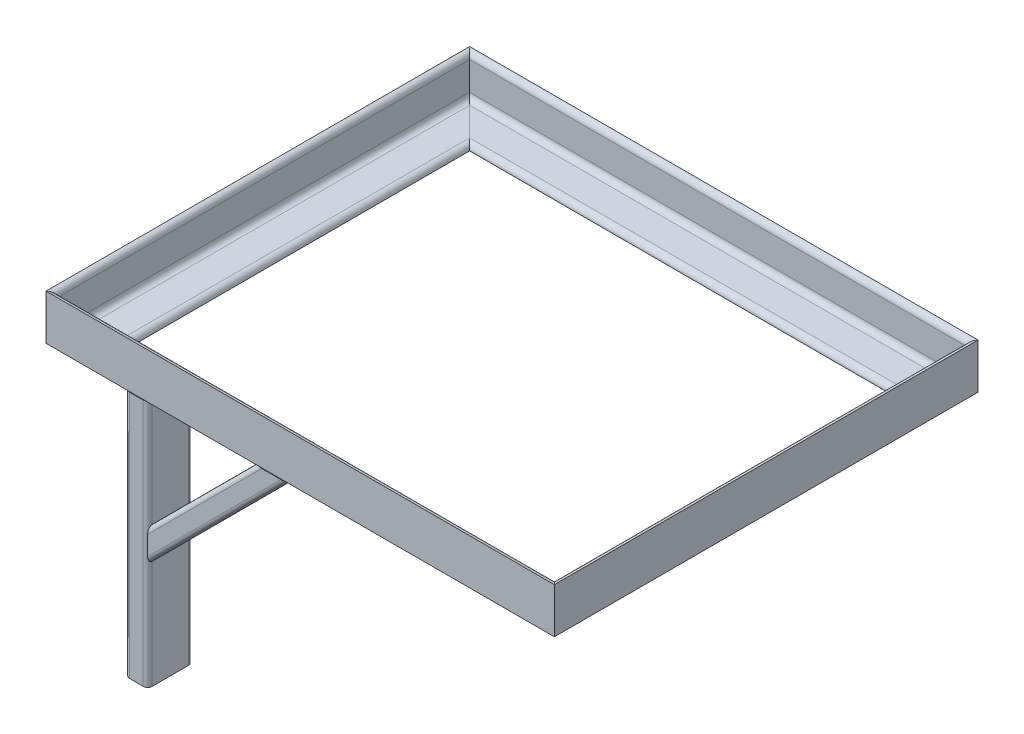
ISO-10303-21;
HEADER;
FILE_DESCRIPTION(('STEP AP214'),'2;1');
FILE_NAME('part.step','',(''),(''),'','','');
FILE_SCHEMA(('AUTOMOTIVE_DESIGN { 1 0 10303 214 1 1 1 1 }'));
ENDSEC;
DATA;
#1=APPLICATION_CONTEXT('core data for automotive mechanical design processes');
#2=APPLICATION_PROTOCOL_DEFINITION('international standard','automotive_design',2000,#1);
#3=PRODUCT_CONTEXT('',#1,'mechanical');
#4=PRODUCT('Part','Part','',(#3));
#5=PRODUCT_RELATED_PRODUCT_CATEGORY('part','',(#4));
#6=PRODUCT_DEFINITION_FORMATION('','',#4);
#7=PRODUCT_DEFINITION_CONTEXT('part definition',#1,'design');
#8=PRODUCT_DEFINITION('design','',#6,#7);
#9=PRODUCT_DEFINITION_SHAPE('','',#8);
#10=(LENGTH_UNIT() NAMED_UNIT(*) SI_UNIT(.MILLI.,.METRE.));
#11=(NAMED_UNIT(*) PLANE_ANGLE_UNIT() SI_UNIT($,.RADIAN.));
#12=(NAMED_UNIT(*) SI_UNIT($,.STERADIAN.) SOLID_ANGLE_UNIT());
#13=UNCERTAINTY_MEASURE_WITH_UNIT(LENGTH_MEASURE(1.E-05),#10,'distance_accuracy_value','');
#14=(GEOMETRIC_REPRESENTATION_CONTEXT(3) GLOBAL_UNCERTAINTY_ASSIGNED_CONTEXT((#13)) GLOBAL_UNIT_ASSIGNED_CONTEXT((#10,
#11,#12)) REPRESENTATION_CONTEXT('',''));
#15=CARTESIAN_POINT('',(0.,0.,0.));
#16=DIRECTION('',(0.,0.,1.));
#17=DIRECTION('',(1.,0.,0.));
#18=AXIS2_PLACEMENT_3D('',#15,#16,#17);
#19=CARTESIAN_POINT('',(-1.51471862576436,491.514718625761,367.));
#20=DIRECTION('',(-0.707106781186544,-0.707106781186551,0.));
#21=DIRECTION('',(0.707106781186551,-0.707106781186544,0.));
#22=AXIS2_PLACEMENT_3D('',#19,#20,#21);
#23=CYLINDRICAL_SURFACE('',#22,8.00000000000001);
#24=CARTESIAN_POINT('',(-270.,223.029437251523,367.));
#25=DIRECTION('',(-1.,0.,0.));
#26=DIRECTION('',(0.,-1.,0.));
#27=AXIS2_PLACEMENT_3D('',#24,#25,#26);
#28=ELLIPSE('',#27,11.3137084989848,8.00000000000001);
#29=CARTESIAN_POINT('',(-270.,211.715728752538,367.));
#30=VERTEX_POINT('',#29);
#31=CARTESIAN_POINT('',(-270.,223.029437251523,375.));
#32=VERTEX_POINT('',#31);
#33=EDGE_CURVE('E270',#30,#32,#28,.T.);
#34=ORIENTED_EDGE('',*,*,#33,.F.);
#35=DIRECTION('',(-0.707106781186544,-0.707106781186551,0.));
#36=VECTOR('',#35,1.);
#37=CARTESIAN_POINT('',(4.14213562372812,485.857864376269,367.));
#38=LINE('',#37,#36);
#39=CARTESIAN_POINT('',(-22.7157287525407,459.,367.));
#40=VERTEX_POINT('',#39);
#41=EDGE_CURVE('E202',#40,#30,#38,.T.);
#42=ORIENTED_EDGE('',*,*,#41,.F.);
#43=CARTESIAN_POINT('',(-34.0294372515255,459.,367.));
#44=DIRECTION('',(0.,-1.,0.));
#45=DIRECTION('',(-1.,0.,0.));
#46=AXIS2_PLACEMENT_3D('',#43,#44,#45);
#47=ELLIPSE('',#46,11.3137084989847,8.00000000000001);
#48=CARTESIAN_POINT('',(-34.0294372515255,459.,375.));
#49=VERTEX_POINT('',#48);
#50=EDGE_CURVE('E297',#40,#49,#47,.T.);
#51=ORIENTED_EDGE('',*,*,#50,.T.);
#52=DIRECTION('',(-0.707106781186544,-0.707106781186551,0.));
#53=VECTOR('',#52,1.);
#54=CARTESIAN_POINT('',(-1.51471862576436,491.514718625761,375.));
#55=LINE('',#54,#53);
#56=EDGE_CURVE('E135',#49,#32,#55,.T.);
#57=ORIENTED_EDGE('',*,*,#56,.T.);
#58=EDGE_LOOP('',(#34,#42,#51,#57));
#59=FACE_BOUND('',#58,.T.);
#60=ADVANCED_FACE('F129',(#59),#23,.T.);
#61=CARTESIAN_POINT('',(-18.4852813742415,508.485281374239,375.));
#62=DIRECTION('',(0.,0.,-1.));
#63=DIRECTION('',(-1.,0.,0.));
#64=AXIS2_PLACEMENT_3D('',#61,#62,#63);
#65=PLANE('',#64);
#66=DIRECTION('',(0.,-1.,0.));
#67=VECTOR('',#66,1.);
#68=CARTESIAN_POINT('',(-270.,500.,375.));
#69=LINE('',#68,#67);
#70=CARTESIAN_POINT('',(-270.,256.970562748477,375.));
#71=VERTEX_POINT('',#70);
#72=EDGE_CURVE('E294',#71,#32,#69,.T.);
#73=ORIENTED_EDGE('',*,*,#72,.T.);
#74=ORIENTED_EDGE('',*,*,#56,.F.);
#75=DIRECTION('',(-1.,0.,0.));
#76=VECTOR('',#75,1.);
#77=CARTESIAN_POINT('',(-18.4852813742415,459.,375.));
#78=LINE('',#77,#76);
#79=CARTESIAN_POINT('',(-67.9705627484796,459.,375.));
#80=VERTEX_POINT('',#79);
#81=EDGE_CURVE('E287',#49,#80,#78,.T.);
#82=ORIENTED_EDGE('',*,*,#81,.T.);
#83=DIRECTION('',(-0.707106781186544,-0.707106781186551,0.));
#84=VECTOR('',#83,1.);
#85=CARTESIAN_POINT('',(-18.4852813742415,508.485281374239,375.));
#86=LINE('',#85,#84);
#87=EDGE_CURVE('E290',#80,#71,#86,.T.);
#88=ORIENTED_EDGE('',*,*,#87,.T.);
#89=EDGE_LOOP('',(#73,#74,#82,#88));
#90=FACE_BOUND('',#89,.T.);
#91=ADVANCED_FACE('F420',(#90),#65,.F.);
#92=CARTESIAN_POINT('',(-18.4852813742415,508.485281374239,367.));
#93=DIRECTION('',(-0.707106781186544,-0.707106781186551,0.));
#94=DIRECTION('',(0.707106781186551,-0.707106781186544,0.));
#95=AXIS2_PLACEMENT_3D('',#92,#93,#94);
#96=CYLINDRICAL_SURFACE('',#95,8.00000000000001);
#97=CARTESIAN_POINT('',(-270.,256.970562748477,367.));
#98=DIRECTION('',(-1.,0.,0.));
#99=DIRECTION('',(0.,-1.,0.));
#100=AXIS2_PLACEMENT_3D('',#97,#98,#99);
#101=ELLIPSE('',#100,11.3137084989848,8.00000000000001);
#102=CARTESIAN_POINT('',(-270.,268.284271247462,367.));
#103=VERTEX_POINT('',#102);
#104=EDGE_CURVE('E336',#71,#103,#101,.T.);
#105=ORIENTED_EDGE('',*,*,#104,.F.);
#106=ORIENTED_EDGE('',*,*,#87,.F.);
#107=CARTESIAN_POINT('',(-67.9705627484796,459.,367.));
#108=DIRECTION('',(0.,-1.,0.));
#109=DIRECTION('',(-1.,0.,0.));
#110=AXIS2_PLACEMENT_3D('',#107,#108,#109);
#111=ELLIPSE('',#110,11.3137084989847,8.00000000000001);
#112=CARTESIAN_POINT('',(-79.2842712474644,459.,367.));
#113=VERTEX_POINT('',#112);
#114=EDGE_CURVE('E283',#80,#113,#111,.T.);
#115=ORIENTED_EDGE('',*,*,#114,.T.);
#116=DIRECTION('',(-0.707106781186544,-0.707106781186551,0.));
#117=VECTOR('',#116,1.);
#118=CARTESIAN_POINT('',(-24.142135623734,514.142135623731,367.));
#119=LINE('',#118,#117);
#120=EDGE_CURVE('E279',#113,#103,#119,.T.);
#121=ORIENTED_EDGE('',*,*,#120,.T.);
#122=EDGE_LOOP('',(#105,#106,#115,#121));
#123=FACE_BOUND('',#122,.T.);
#124=ADVANCED_FACE('F422',(#123),#96,.T.);
#125=CARTESIAN_POINT('',(1.31370849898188,488.686291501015,303.));
#126=DIRECTION('',(-0.707106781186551,0.707106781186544,0.));
#127=DIRECTION('',(-0.707106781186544,-0.707106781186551,0.));
#128=AXIS2_PLACEMENT_3D('',#125,#126,#127);
#129=PLANE('',#128);
#130=DIRECTION('',(-0.707106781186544,-0.707106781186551,0.));
#131=VECTOR('',#130,1.);
#132=CARTESIAN_POINT('',(1.31370849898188,488.686291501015,303.));
#133=LINE('',#132,#131);
#134=CARTESIAN_POINT('',(-28.3725830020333,459.,303.));
#135=VERTEX_POINT('',#134);
#136=CARTESIAN_POINT('',(-270.,217.372583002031,303.));
#137=VERTEX_POINT('',#136);
#138=EDGE_CURVE('E275',#135,#137,#133,.T.);
#139=ORIENTED_EDGE('',*,*,#138,.T.);
#140=DIRECTION('',(0.,0.,1.));
#141=VECTOR('',#140,1.);
#142=CARTESIAN_POINT('',(-270.,217.372583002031,303.));
#143=LINE('',#142,#141);
#144=CARTESIAN_POINT('',(-270.,217.37258300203,367.));
#145=VERTEX_POINT('',#144);
#146=EDGE_CURVE('E171',#137,#145,#143,.T.);
#147=ORIENTED_EDGE('',*,*,#146,.T.);
#148=DIRECTION('',(-0.707106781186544,-0.707106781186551,0.));
#149=VECTOR('',#148,1.);
#150=CARTESIAN_POINT('',(1.31370849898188,488.686291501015,367.));
#151=LINE('',#150,#149);
#152=CARTESIAN_POINT('',(-28.3725830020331,459.,367.));
#153=VERTEX_POINT('',#152);
#154=EDGE_CURVE('E274',#153,#145,#151,.T.);
#155=ORIENTED_EDGE('',*,*,#154,.F.);
#156=DIRECTION('',(0.,0.,1.));
#157=VECTOR('',#156,1.);
#158=CARTESIAN_POINT('',(-28.3725830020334,459.,303.));
#159=LINE('',#158,#157);
#160=EDGE_CURVE('E191',#135,#153,#159,.T.);
#161=ORIENTED_EDGE('',*,*,#160,.F.);
#162=EDGE_LOOP('',(#139,#147,#155,#161));
#163=FACE_BOUND('',#162,.T.);
#164=ADVANCED_FACE('F272',(#163),#129,.T.);
#165=CARTESIAN_POINT('',(-1.51471862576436,491.514718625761,303.));
#166=DIRECTION('',(-0.707106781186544,-0.707106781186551,0.));
#167=DIRECTION('',(0.707106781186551,-0.707106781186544,0.));
#168=AXIS2_PLACEMENT_3D('',#165,#166,#167);
#169=CYLINDRICAL_SURFACE('',#168,4.);
#170=DIRECTION('',(-0.707106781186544,-0.707106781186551,0.));
#171=VECTOR('',#170,1.);
#172=CARTESIAN_POINT('',(-1.51471862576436,491.514718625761,299.));
#173=LINE('',#172,#171);
#174=CARTESIAN_POINT('',(-34.0294372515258,459.,299.));
#175=VERTEX_POINT('',#174);
#176=CARTESIAN_POINT('',(-270.,223.029437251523,299.));
#177=VERTEX_POINT('',#176);
#178=EDGE_CURVE('E278',#175,#177,#173,.T.);
#179=ORIENTED_EDGE('',*,*,#178,.T.);
#180=CARTESIAN_POINT('',(-270.,223.029437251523,303.));
#181=DIRECTION('',(-1.,0.,0.));
#182=DIRECTION('',(0.,-1.,0.));
#183=AXIS2_PLACEMENT_3D('',#180,#181,#182);
#184=ELLIPSE('',#183,5.65685424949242,4.);
#185=EDGE_CURVE('E166',#177,#137,#184,.T.);
#186=ORIENTED_EDGE('',*,*,#185,.T.);
#187=ORIENTED_EDGE('',*,*,#138,.F.);
#188=CARTESIAN_POINT('',(-34.0294372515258,459.,303.));
#189=DIRECTION('',(0.,-1.,0.));
#190=DIRECTION('',(-1.,0.,0.));
#191=AXIS2_PLACEMENT_3D('',#188,#189,#190);
#192=ELLIPSE('',#191,5.65685424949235,4.);
#193=EDGE_CURVE('E265',#175,#135,#192,.T.);
#194=ORIENTED_EDGE('',*,*,#193,.F.);
#195=EDGE_LOOP('',(#179,#186,#187,#194));
#196=FACE_BOUND('',#195,.T.);
#197=ADVANCED_FACE('F280',(#196),#169,.F.);
#198=CARTESIAN_POINT('',(-1.51471862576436,491.514718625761,299.));
#199=DIRECTION('',(0.,0.,1.));
#200=DIRECTION('',(1.,0.,0.));
#201=AXIS2_PLACEMENT_3D('',#198,#199,#200);
#202=PLANE('',#201);
#203=DIRECTION('',(-0.707106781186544,-0.707106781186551,0.));
#204=VECTOR('',#203,1.);
#205=CARTESIAN_POINT('',(-18.4852813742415,508.485281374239,299.));
#206=LINE('',#205,#204);
#207=CARTESIAN_POINT('',(-67.9705627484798,459.,299.));
#208=VERTEX_POINT('',#207);
#209=CARTESIAN_POINT('',(-270.,256.970562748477,299.));
#210=VERTEX_POINT('',#209);
#211=EDGE_CURVE('E361',#208,#210,#206,.T.);
#212=ORIENTED_EDGE('',*,*,#211,.T.);
#213=DIRECTION('',(0.,-1.,0.));
#214=VECTOR('',#213,1.);
#215=CARTESIAN_POINT('',(-270.,491.514718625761,299.));
#216=LINE('',#215,#214);
#217=EDGE_CURVE('E359',#210,#177,#216,.T.);
#218=ORIENTED_EDGE('',*,*,#217,.T.);
#219=ORIENTED_EDGE('',*,*,#178,.F.);
#220=DIRECTION('',(1.,0.,0.));
#221=VECTOR('',#220,1.);
#222=CARTESIAN_POINT('',(-1.51471862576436,459.,299.));
#223=LINE('',#222,#221);
#224=EDGE_CURVE('E258',#208,#175,#223,.T.);
#225=ORIENTED_EDGE('',*,*,#224,.F.);
#226=EDGE_LOOP('',(#212,#218,#219,#225));
#227=FACE_BOUND('',#226,.T.);
#228=ADVANCED_FACE('F381',(#227),#202,.T.);
#229=CARTESIAN_POINT('',(-18.4852813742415,508.485281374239,303.));
#230=DIRECTION('',(-0.707106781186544,-0.707106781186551,0.));
#231=DIRECTION('',(0.707106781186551,-0.707106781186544,0.));
#232=AXIS2_PLACEMENT_3D('',#229,#230,#231);
#233=CYLINDRICAL_SURFACE('',#232,4.);
#234=DIRECTION('',(-0.707106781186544,-0.707106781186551,0.));
#235=VECTOR('',#234,1.);
#236=CARTESIAN_POINT('',(-21.3137084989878,511.313708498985,303.));
#237=LINE('',#236,#235);
#238=CARTESIAN_POINT('',(-73.6274169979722,459.,303.));
#239=VERTEX_POINT('',#238);
#240=CARTESIAN_POINT('',(-270.,262.62741699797,303.));
#241=VERTEX_POINT('',#240);
#242=EDGE_CURVE('E360',#239,#241,#237,.T.);
#243=ORIENTED_EDGE('',*,*,#242,.T.);
#244=CARTESIAN_POINT('',(-270.,256.970562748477,303.));
#245=DIRECTION('',(-1.,0.,0.));
#246=DIRECTION('',(0.,-1.,0.));
#247=AXIS2_PLACEMENT_3D('',#244,#245,#246);
#248=ELLIPSE('',#247,5.65685424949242,4.);
#249=EDGE_CURVE('E358',#241,#210,#248,.T.);
#250=ORIENTED_EDGE('',*,*,#249,.T.);
#251=ORIENTED_EDGE('',*,*,#211,.F.);
#252=CARTESIAN_POINT('',(-67.9705627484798,459.,303.));
#253=DIRECTION('',(0.,-1.,0.));
#254=DIRECTION('',(-1.,0.,0.));
#255=AXIS2_PLACEMENT_3D('',#252,#253,#254);
#256=ELLIPSE('',#255,5.65685424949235,4.);
#257=EDGE_CURVE('E321',#239,#208,#256,.T.);
#258=ORIENTED_EDGE('',*,*,#257,.F.);
#259=EDGE_LOOP('',(#243,#250,#251,#258));
#260=FACE_BOUND('',#259,.T.);
#261=ADVANCED_FACE('F390',(#260),#233,.F.);
#262=CARTESIAN_POINT('',(-21.3137084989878,511.313708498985,367.));
#263=DIRECTION('',(0.707106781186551,-0.707106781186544,0.));
#264=DIRECTION('',(0.707106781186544,0.707106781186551,0.));
#265=AXIS2_PLACEMENT_3D('',#262,#263,#264);
#266=PLANE('',#265);
#267=DIRECTION('',(-0.707106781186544,-0.707106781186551,0.));
#268=VECTOR('',#267,1.);
#269=CARTESIAN_POINT('',(-21.3137084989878,511.313708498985,367.));
#270=LINE('',#269,#268);
#271=CARTESIAN_POINT('',(-73.627416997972,459.,367.));
#272=VERTEX_POINT('',#271);
#273=CARTESIAN_POINT('',(-270.,262.62741699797,367.));
#274=VERTEX_POINT('',#273);
#275=EDGE_CURVE('E354',#272,#274,#270,.T.);
#276=ORIENTED_EDGE('',*,*,#275,.T.);
#277=DIRECTION('',(0.,0.,-1.));
#278=VECTOR('',#277,1.);
#279=CARTESIAN_POINT('',(-270.,262.62741699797,367.));
#280=LINE('',#279,#278);
#281=EDGE_CURVE('E355',#274,#241,#280,.T.);
#282=ORIENTED_EDGE('',*,*,#281,.T.);
#283=ORIENTED_EDGE('',*,*,#242,.F.);
#284=DIRECTION('',(0.,0.,-1.));
#285=VECTOR('',#284,1.);
#286=CARTESIAN_POINT('',(-73.627416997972,459.,367.));
#287=LINE('',#286,#285);
#288=EDGE_CURVE('E325',#272,#239,#287,.T.);
#289=ORIENTED_EDGE('',*,*,#288,.F.);
#290=EDGE_LOOP('',(#276,#282,#283,#289));
#291=FACE_BOUND('',#290,.T.);
#292=ADVANCED_FACE('F393',(#291),#266,.T.);
#293=CARTESIAN_POINT('',(-18.4852813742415,508.485281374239,367.));
#294=DIRECTION('',(-0.707106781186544,-0.707106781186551,0.));
#295=DIRECTION('',(0.707106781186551,-0.707106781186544,0.));
#296=AXIS2_PLACEMENT_3D('',#293,#294,#295);
#297=CYLINDRICAL_SURFACE('',#296,4.);
#298=DIRECTION('',(-0.707106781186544,-0.707106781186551,0.));
#299=VECTOR('',#298,1.);
#300=CARTESIAN_POINT('',(-18.4852813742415,508.485281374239,371.));
#301=LINE('',#300,#299);
#302=CARTESIAN_POINT('',(-67.9705627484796,459.,371.));
#303=VERTEX_POINT('',#302);
#304=CARTESIAN_POINT('',(-270.,256.970562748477,371.));
#305=VERTEX_POINT('',#304);
#306=EDGE_CURVE('E353',#303,#305,#301,.T.);
#307=ORIENTED_EDGE('',*,*,#306,.T.);
#308=CARTESIAN_POINT('',(-270.,256.970562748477,367.));
#309=DIRECTION('',(-1.,0.,0.));
#310=DIRECTION('',(0.,-1.,0.));
#311=AXIS2_PLACEMENT_3D('',#308,#309,#310);
#312=ELLIPSE('',#311,5.65685424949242,4.);
#313=EDGE_CURVE('E348',#305,#274,#312,.T.);
#314=ORIENTED_EDGE('',*,*,#313,.T.);
#315=ORIENTED_EDGE('',*,*,#275,.F.);
#316=CARTESIAN_POINT('',(-67.9705627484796,459.,367.));
#317=DIRECTION('',(0.,-1.,0.));
#318=DIRECTION('',(-1.,0.,0.));
#319=AXIS2_PLACEMENT_3D('',#316,#317,#318);
#320=ELLIPSE('',#319,5.65685424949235,4.);
#321=EDGE_CURVE('E318',#303,#272,#320,.T.);
#322=ORIENTED_EDGE('',*,*,#321,.F.);
#323=EDGE_LOOP('',(#307,#314,#315,#322));
#324=FACE_BOUND('',#323,.T.);
#325=ADVANCED_FACE('F398',(#324),#297,.F.);
#326=CARTESIAN_POINT('',(-18.4852813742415,508.485281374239,371.));
#327=DIRECTION('',(0.,0.,-1.));
#328=DIRECTION('',(-1.,0.,0.));
#329=AXIS2_PLACEMENT_3D('',#326,#327,#328);
#330=PLANE('',#329);
#331=DIRECTION('',(-0.707106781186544,-0.707106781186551,0.));
#332=VECTOR('',#331,1.);
#333=CARTESIAN_POINT('',(-1.51471862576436,491.514718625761,371.));
#334=LINE('',#333,#332);
#335=CARTESIAN_POINT('',(-34.0294372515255,459.,371.));
#336=VERTEX_POINT('',#335);
#337=CARTESIAN_POINT('',(-270.,223.029437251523,371.));
#338=VERTEX_POINT('',#337);
#339=EDGE_CURVE('E350',#336,#338,#334,.T.);
#340=ORIENTED_EDGE('',*,*,#339,.T.);
#341=DIRECTION('',(0.,1.,0.));
#342=VECTOR('',#341,1.);
#343=CARTESIAN_POINT('',(-270.,508.485281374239,371.));
#344=LINE('',#343,#342);
#345=EDGE_CURVE('E341',#338,#305,#344,.T.);
#346=ORIENTED_EDGE('',*,*,#345,.T.);
#347=ORIENTED_EDGE('',*,*,#306,.F.);
#348=DIRECTION('',(-1.,0.,0.));
#349=VECTOR('',#348,1.);
#350=CARTESIAN_POINT('',(-18.4852813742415,459.,371.));
#351=LINE('',#350,#349);
#352=EDGE_CURVE('E319',#336,#303,#351,.T.);
#353=ORIENTED_EDGE('',*,*,#352,.F.);
#354=EDGE_LOOP('',(#340,#346,#347,#353));
#355=FACE_BOUND('',#354,.T.);
#356=ADVANCED_FACE('F399',(#355),#330,.T.);
#357=CARTESIAN_POINT('',(-1.51471862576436,491.514718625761,367.));
#358=DIRECTION('',(-0.707106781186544,-0.707106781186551,0.));
#359=DIRECTION('',(0.707106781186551,-0.707106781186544,0.));
#360=AXIS2_PLACEMENT_3D('',#357,#358,#359);
#361=CYLINDRICAL_SURFACE('',#360,4.);
#362=ORIENTED_EDGE('',*,*,#154,.T.);
#363=CARTESIAN_POINT('',(-270.,223.029437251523,367.));
#364=DIRECTION('',(-1.,0.,0.));
#365=DIRECTION('',(0.,-1.,0.));
#366=AXIS2_PLACEMENT_3D('',#363,#364,#365);
#367=ELLIPSE('',#366,5.65685424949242,4.);
#368=EDGE_CURVE('E150',#145,#338,#367,.T.);
#369=ORIENTED_EDGE('',*,*,#368,.T.);
#370=ORIENTED_EDGE('',*,*,#339,.F.);
#371=CARTESIAN_POINT('',(-34.0294372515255,459.,367.));
#372=DIRECTION('',(0.,-1.,0.));
#373=DIRECTION('',(-1.,0.,0.));
#374=AXIS2_PLACEMENT_3D('',#371,#372,#373);
#375=ELLIPSE('',#374,5.65685424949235,4.);
#376=EDGE_CURVE('E273',#153,#336,#375,.T.);
#377=ORIENTED_EDGE('',*,*,#376,.F.);
#378=EDGE_LOOP('',(#362,#369,#370,#377));
#379=FACE_BOUND('',#378,.T.);
#380=ADVANCED_FACE('F401',(#379),#361,.F.);
#381=CARTESIAN_POINT('',(-24.142135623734,514.142135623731,367.));
#382=DIRECTION('',(0.707106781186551,-0.707106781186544,0.));
#383=DIRECTION('',(0.707106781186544,0.707106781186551,0.));
#384=AXIS2_PLACEMENT_3D('',#381,#382,#383);
#385=PLANE('',#384);
#386=DIRECTION('',(0.,0.,-1.));
#387=VECTOR('',#386,1.);
#388=CARTESIAN_POINT('',(-270.,268.284271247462,367.));
#389=LINE('',#388,#387);
#390=CARTESIAN_POINT('',(-270.,268.284271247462,303.));
#391=VERTEX_POINT('',#390);
#392=EDGE_CURVE('E334',#103,#391,#389,.T.);
#393=ORIENTED_EDGE('',*,*,#392,.F.);
#394=ORIENTED_EDGE('',*,*,#120,.F.);
#395=DIRECTION('',(0.,0.,-1.));
#396=VECTOR('',#395,1.);
#397=CARTESIAN_POINT('',(-79.2842712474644,459.,367.));
#398=LINE('',#397,#396);
#399=CARTESIAN_POINT('',(-79.2842712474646,459.,303.));
#400=VERTEX_POINT('',#399);
#401=EDGE_CURVE('E179',#113,#400,#398,.T.);
#402=ORIENTED_EDGE('',*,*,#401,.T.);
#403=DIRECTION('',(-0.707106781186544,-0.707106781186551,0.));
#404=VECTOR('',#403,1.);
#405=CARTESIAN_POINT('',(-24.142135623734,514.142135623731,303.));
#406=LINE('',#405,#404);
#407=EDGE_CURVE('E314',#400,#391,#406,.T.);
#408=ORIENTED_EDGE('',*,*,#407,.T.);
#409=EDGE_LOOP('',(#393,#394,#402,#408));
#410=FACE_BOUND('',#409,.T.);
#411=ADVANCED_FACE('F403',(#410),#385,.F.);
#412=CARTESIAN_POINT('',(-18.4852813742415,508.485281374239,303.));
#413=DIRECTION('',(-0.707106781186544,-0.707106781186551,0.));
#414=DIRECTION('',(0.707106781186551,-0.707106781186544,0.));
#415=AXIS2_PLACEMENT_3D('',#412,#413,#414);
#416=CYLINDRICAL_SURFACE('',#415,8.00000000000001);
#417=CARTESIAN_POINT('',(-270.,256.970562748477,303.));
#418=DIRECTION('',(-1.,0.,0.));
#419=DIRECTION('',(0.,-1.,0.));
#420=AXIS2_PLACEMENT_3D('',#417,#418,#419);
#421=ELLIPSE('',#420,11.3137084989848,8.00000000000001);
#422=CARTESIAN_POINT('',(-270.,256.970562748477,295.));
#423=VERTEX_POINT('',#422);
#424=EDGE_CURVE('E335',#391,#423,#421,.T.);
#425=ORIENTED_EDGE('',*,*,#424,.F.);
#426=ORIENTED_EDGE('',*,*,#407,.F.);
#427=CARTESIAN_POINT('',(-67.9705627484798,459.,303.));
#428=DIRECTION('',(0.,-1.,0.));
#429=DIRECTION('',(-1.,0.,0.));
#430=AXIS2_PLACEMENT_3D('',#427,#428,#429);
#431=ELLIPSE('',#430,11.3137084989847,8.00000000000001);
#432=CARTESIAN_POINT('',(-67.9705627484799,459.,295.));
#433=VERTEX_POINT('',#432);
#434=EDGE_CURVE('E315',#400,#433,#431,.T.);
#435=ORIENTED_EDGE('',*,*,#434,.T.);
#436=DIRECTION('',(-0.707106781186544,-0.707106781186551,0.));
#437=VECTOR('',#436,1.);
#438=CARTESIAN_POINT('',(-18.4852813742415,508.485281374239,295.));
#439=LINE('',#438,#437);
#440=EDGE_CURVE('E311',#433,#423,#439,.T.);
#441=ORIENTED_EDGE('',*,*,#440,.T.);
#442=EDGE_LOOP('',(#425,#426,#435,#441));
#443=FACE_BOUND('',#442,.T.);
#444=ADVANCED_FACE('F411',(#443),#416,.T.);
#445=CARTESIAN_POINT('',(-1.51471862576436,491.514718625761,295.));
#446=DIRECTION('',(0.,0.,1.));
#447=DIRECTION('',(1.,0.,0.));
#448=AXIS2_PLACEMENT_3D('',#445,#446,#447);
#449=PLANE('',#448);
#450=DIRECTION('',(0.,-1.,0.));
#451=VECTOR('',#450,1.);
#452=CARTESIAN_POINT('',(-270.,500.,295.));
#453=LINE('',#452,#451);
#454=CARTESIAN_POINT('',(-270.,223.029437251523,295.));
#455=VERTEX_POINT('',#454);
#456=EDGE_CURVE('E327',#423,#455,#453,.T.);
#457=ORIENTED_EDGE('',*,*,#456,.F.);
#458=ORIENTED_EDGE('',*,*,#440,.F.);
#459=DIRECTION('',(1.,0.,0.));
#460=VECTOR('',#459,1.);
#461=CARTESIAN_POINT('',(-1.51471862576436,459.,295.));
#462=LINE('',#461,#460);
#463=CARTESIAN_POINT('',(-34.0294372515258,459.,295.));
#464=VERTEX_POINT('',#463);
#465=EDGE_CURVE('E308',#433,#464,#462,.T.);
#466=ORIENTED_EDGE('',*,*,#465,.T.);
#467=DIRECTION('',(-0.707106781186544,-0.707106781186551,0.));
#468=VECTOR('',#467,1.);
#469=CARTESIAN_POINT('',(-1.51471862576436,491.514718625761,295.));
#470=LINE('',#469,#468);
#471=EDGE_CURVE('E310',#464,#455,#470,.T.);
#472=ORIENTED_EDGE('',*,*,#471,.T.);
#473=EDGE_LOOP('',(#457,#458,#466,#472));
#474=FACE_BOUND('',#473,.T.);
#475=ADVANCED_FACE('F427',(#474),#449,.F.);
#476=CARTESIAN_POINT('',(-1.51471862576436,491.514718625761,303.));
#477=DIRECTION('',(-0.707106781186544,-0.707106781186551,0.));
#478=DIRECTION('',(0.707106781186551,-0.707106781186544,0.));
#479=AXIS2_PLACEMENT_3D('',#476,#477,#478);
#480=CYLINDRICAL_SURFACE('',#479,8.00000000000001);
#481=CARTESIAN_POINT('',(-270.,223.029437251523,303.));
#482=DIRECTION('',(-1.,0.,0.));
#483=DIRECTION('',(0.,-1.,0.));
#484=AXIS2_PLACEMENT_3D('',#481,#482,#483);
#485=ELLIPSE('',#484,11.3137084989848,8.00000000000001);
#486=CARTESIAN_POINT('',(-270.,211.715728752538,303.));
#487=VERTEX_POINT('',#486);
#488=EDGE_CURVE('E136',#455,#487,#485,.T.);
#489=ORIENTED_EDGE('',*,*,#488,.F.);
#490=ORIENTED_EDGE('',*,*,#471,.F.);
#491=CARTESIAN_POINT('',(-34.0294372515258,459.,303.));
#492=DIRECTION('',(0.,-1.,0.));
#493=DIRECTION('',(-1.,0.,0.));
#494=AXIS2_PLACEMENT_3D('',#491,#492,#493);
#495=ELLIPSE('',#494,11.3137084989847,8.00000000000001);
#496=CARTESIAN_POINT('',(-22.715728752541,459.,303.));
#497=VERTEX_POINT('',#496);
#498=EDGE_CURVE('E304',#464,#497,#495,.T.);
#499=ORIENTED_EDGE('',*,*,#498,.T.);
#500=DIRECTION('',(-0.707106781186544,-0.707106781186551,0.));
#501=VECTOR('',#500,1.);
#502=CARTESIAN_POINT('',(4.14213562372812,485.857864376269,303.));
#503=LINE('',#502,#501);
#504=EDGE_CURVE('E214',#497,#487,#503,.T.);
#505=ORIENTED_EDGE('',*,*,#504,.T.);
#506=EDGE_LOOP('',(#489,#490,#499,#505));
#507=FACE_BOUND('',#506,.T.);
#508=ADVANCED_FACE('F432',(#507),#480,.T.);
#509=CARTESIAN_POINT('',(4.14213562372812,485.857864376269,303.));
#510=DIRECTION('',(-0.707106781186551,0.707106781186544,0.));
#511=DIRECTION('',(-0.707106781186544,-0.707106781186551,0.));
#512=AXIS2_PLACEMENT_3D('',#509,#510,#511);
#513=PLANE('',#512);
#514=DIRECTION('',(0.,0.,1.));
#515=VECTOR('',#514,1.);
#516=CARTESIAN_POINT('',(-270.,211.715728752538,303.));
#517=LINE('',#516,#515);
#518=EDGE_CURVE('E14',#487,#30,#517,.T.);
#519=ORIENTED_EDGE('',*,*,#518,.F.);
#520=ORIENTED_EDGE('',*,*,#504,.F.);
#521=DIRECTION('',(0.,0.,1.));
#522=VECTOR('',#521,1.);
#523=CARTESIAN_POINT('',(-22.715728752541,459.,303.));
#524=LINE('',#523,#522);
#525=EDGE_CURVE('E303',#497,#40,#524,.T.);
#526=ORIENTED_EDGE('',*,*,#525,.T.);
#527=ORIENTED_EDGE('',*,*,#41,.T.);
#528=EDGE_LOOP('',(#519,#520,#526,#527));
#529=FACE_BOUND('',#528,.T.);
#530=ADVANCED_FACE('F438',(#529),#513,.F.);
#531=CARTESIAN_POINT('',(-450.,459.,295.));
#532=DIRECTION('',(0.,-1.,0.));
#533=DIRECTION('',(0.,0.,-1.));
#534=AXIS2_PLACEMENT_3D('',#531,#532,#533);
#535=PLANE('',#534);
#536=ORIENTED_EDGE('',*,*,#160,.T.);
#537=ORIENTED_EDGE('',*,*,#376,.T.);
#538=ORIENTED_EDGE('',*,*,#352,.T.);
#539=ORIENTED_EDGE('',*,*,#321,.T.);
#540=ORIENTED_EDGE('',*,*,#288,.T.);
#541=ORIENTED_EDGE('',*,*,#257,.T.);
#542=ORIENTED_EDGE('',*,*,#224,.T.);
#543=ORIENTED_EDGE('',*,*,#193,.T.);
#544=EDGE_LOOP('',(#536,#537,#538,#539,#540,#541,#542,#543));
#545=FACE_BOUND('',#544,.T.);
#546=ORIENTED_EDGE('',*,*,#114,.F.);
#547=ORIENTED_EDGE('',*,*,#81,.F.);
#548=ORIENTED_EDGE('',*,*,#50,.F.);
#549=ORIENTED_EDGE('',*,*,#525,.F.);
#550=ORIENTED_EDGE('',*,*,#498,.F.);
#551=ORIENTED_EDGE('',*,*,#465,.F.);
#552=ORIENTED_EDGE('',*,*,#434,.F.);
#553=ORIENTED_EDGE('',*,*,#401,.F.);
#554=EDGE_LOOP('',(#546,#547,#548,#549,#550,#551,#552,#553));
#555=FACE_BOUND('',#554,.T.);
#556=ADVANCED_FACE('F263',(#545,#555),#535,.F.);
#557=CARTESIAN_POINT('',(-270.,500.,303.));
#558=DIRECTION('',(-1.,0.,0.));
#559=DIRECTION('',(0.,0.,1.));
#560=AXIS2_PLACEMENT_3D('',#557,#558,#559);
#561=PLANE('',#560);
#562=ORIENTED_EDGE('',*,*,#146,.F.);
#563=ORIENTED_EDGE('',*,*,#185,.F.);
#564=ORIENTED_EDGE('',*,*,#217,.F.);
#565=ORIENTED_EDGE('',*,*,#249,.F.);
#566=ORIENTED_EDGE('',*,*,#281,.F.);
#567=ORIENTED_EDGE('',*,*,#313,.F.);
#568=ORIENTED_EDGE('',*,*,#345,.F.);
#569=ORIENTED_EDGE('',*,*,#368,.F.);
#570=EDGE_LOOP('',(#562,#563,#564,#565,#566,#567,#568,#569));
#571=FACE_BOUND('',#570,.T.);
#572=ORIENTED_EDGE('',*,*,#33,.T.);
#573=ORIENTED_EDGE('',*,*,#72,.F.);
#574=ORIENTED_EDGE('',*,*,#104,.T.);
#575=ORIENTED_EDGE('',*,*,#392,.T.);
#576=ORIENTED_EDGE('',*,*,#424,.T.);
#577=ORIENTED_EDGE('',*,*,#456,.T.);
#578=ORIENTED_EDGE('',*,*,#488,.T.);
#579=ORIENTED_EDGE('',*,*,#518,.T.);
#580=EDGE_LOOP('',(#572,#573,#574,#575,#576,#577,#578,#579));
#581=FACE_BOUND('',#580,.T.);
#582=ADVANCED_FACE('F128',(#571,#581),#561,.T.);
#583=CLOSED_SHELL('',(#60,#91,#124,#164,#197,#228,#261,#292,#325,#356,#380,#411,#444,#475,#508,
#530,#556,#582));
#584=MANIFOLD_SOLID_BREP('B2',#583);
#585=CARTESIAN_POINT('',(-302.,20.,367.));
#586=DIRECTION('',(0.,1.,0.));
#587=DIRECTION('',(0.,0.,1.));
#588=AXIS2_PLACEMENT_3D('',#585,#586,#587);
#589=PLANE('',#588);
#590=CARTESIAN_POINT('',(-278.,20.,367.));
#591=DIRECTION('',(0.,1.,0.));
#592=DIRECTION('',(0.,0.,1.));
#593=AXIS2_PLACEMENT_3D('',#590,#591,#592);
#594=CIRCLE('',#593,4.);
#595=CARTESIAN_POINT('',(-278.,20.,371.));
#596=VERTEX_POINT('',#595);
#597=CARTESIAN_POINT('',(-274.,20.,367.));
#598=VERTEX_POINT('',#597);
#599=EDGE_CURVE('E773',#596,#598,#594,.T.);
#600=ORIENTED_EDGE('',*,*,#599,.T.);
#601=DIRECTION('',(0.,0.,-1.));
#602=VECTOR('',#601,1.);
#603=CARTESIAN_POINT('',(-274.,20.,303.));
#604=LINE('',#603,#602);
#605=CARTESIAN_POINT('',(-274.,20.,303.));
#606=VERTEX_POINT('',#605);
#607=EDGE_CURVE('E774',#598,#606,#604,.T.);
#608=ORIENTED_EDGE('',*,*,#607,.T.);
#609=CARTESIAN_POINT('',(-278.,20.,303.));
#610=DIRECTION('',(0.,1.,0.));
#611=DIRECTION('',(0.,0.,1.));
#612=AXIS2_PLACEMENT_3D('',#609,#610,#611);
#613=CIRCLE('',#612,4.);
#614=CARTESIAN_POINT('',(-278.,20.,299.));
#615=VERTEX_POINT('',#614);
#616=EDGE_CURVE('E769',#606,#615,#613,.T.);
#617=ORIENTED_EDGE('',*,*,#616,.T.);
#618=DIRECTION('',(-1.,0.,0.));
#619=VECTOR('',#618,1.);
#620=CARTESIAN_POINT('',(-278.,20.,299.));
#621=LINE('',#620,#619);
#622=CARTESIAN_POINT('',(-302.,20.,299.));
#623=VERTEX_POINT('',#622);
#624=EDGE_CURVE('E770',#615,#623,#621,.T.);
#625=ORIENTED_EDGE('',*,*,#624,.T.);
#626=CARTESIAN_POINT('',(-302.,20.,303.));
#627=DIRECTION('',(0.,1.,0.));
#628=DIRECTION('',(0.,0.,1.));
#629=AXIS2_PLACEMENT_3D('',#626,#627,#628);
#630=CIRCLE('',#629,4.);
#631=CARTESIAN_POINT('',(-306.,20.,303.));
#632=VERTEX_POINT('',#631);
#633=EDGE_CURVE('E762',#623,#632,#630,.T.);
#634=ORIENTED_EDGE('',*,*,#633,.T.);
#635=DIRECTION('',(0.,0.,1.));
#636=VECTOR('',#635,1.);
#637=CARTESIAN_POINT('',(-306.,20.,367.));
#638=LINE('',#637,#636);
#639=CARTESIAN_POINT('',(-306.,20.,367.));
#640=VERTEX_POINT('',#639);
#641=EDGE_CURVE('E761',#632,#640,#638,.T.);
#642=ORIENTED_EDGE('',*,*,#641,.T.);
#643=CARTESIAN_POINT('',(-302.,20.,367.));
#644=DIRECTION('',(0.,1.,0.));
#645=DIRECTION('',(0.,0.,1.));
#646=AXIS2_PLACEMENT_3D('',#643,#644,#645);
#647=CIRCLE('',#646,4.);
#648=CARTESIAN_POINT('',(-302.,20.,371.));
#649=VERTEX_POINT('',#648);
#650=EDGE_CURVE('E758',#640,#649,#647,.T.);
#651=ORIENTED_EDGE('',*,*,#650,.T.);
#652=DIRECTION('',(1.,0.,0.));
#653=VECTOR('',#652,1.);
#654=CARTESIAN_POINT('',(-302.,20.,371.));
#655=LINE('',#654,#653);
#656=EDGE_CURVE('E752',#649,#596,#655,.T.);
#657=ORIENTED_EDGE('',*,*,#656,.T.);
#658=EDGE_LOOP('',(#600,#608,#617,#625,#634,#642,#651,#657));
#659=FACE_BOUND('',#658,.T.);
#660=CARTESIAN_POINT('',(-302.,20.,367.));
#661=DIRECTION('',(0.,1.,0.));
#662=DIRECTION('',(0.,0.,1.));
#663=AXIS2_PLACEMENT_3D('',#660,#661,#662);
#664=CIRCLE('',#663,8.00000000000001);
#665=CARTESIAN_POINT('',(-310.,20.,367.));
#666=VERTEX_POINT('',#665);
#667=CARTESIAN_POINT('',(-302.,20.,375.));
#668=VERTEX_POINT('',#667);
#669=EDGE_CURVE('E638',#666,#668,#664,.T.);
#670=ORIENTED_EDGE('',*,*,#669,.F.);
#671=DIRECTION('',(0.,0.,1.));
#672=VECTOR('',#671,1.);
#673=CARTESIAN_POINT('',(-310.,20.,367.));
#674=LINE('',#673,#672);
#675=CARTESIAN_POINT('',(-310.,20.,303.));
#676=VERTEX_POINT('',#675);
#677=EDGE_CURVE('E583',#676,#666,#674,.T.);
#678=ORIENTED_EDGE('',*,*,#677,.F.);
#679=CARTESIAN_POINT('',(-302.,20.,303.));
#680=DIRECTION('',(0.,1.,0.));
#681=DIRECTION('',(0.,0.,1.));
#682=AXIS2_PLACEMENT_3D('',#679,#680,#681);
#683=CIRCLE('',#682,8.00000000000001);
#684=CARTESIAN_POINT('',(-302.,20.,295.));
#685=VERTEX_POINT('',#684);
#686=EDGE_CURVE('E742',#685,#676,#683,.T.);
#687=ORIENTED_EDGE('',*,*,#686,.F.);
#688=DIRECTION('',(-1.,0.,0.));
#689=VECTOR('',#688,1.);
#690=CARTESIAN_POINT('',(-278.,20.,295.));
#691=LINE('',#690,#689);
#692=CARTESIAN_POINT('',(-278.,20.,295.));
#693=VERTEX_POINT('',#692);
#694=EDGE_CURVE('E739',#693,#685,#691,.T.);
#695=ORIENTED_EDGE('',*,*,#694,.F.);
#696=CARTESIAN_POINT('',(-278.,20.,303.));
#697=DIRECTION('',(0.,1.,0.));
#698=DIRECTION('',(0.,0.,1.));
#699=AXIS2_PLACEMENT_3D('',#696,#697,#698);
#700=CIRCLE('',#699,8.00000000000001);
#701=CARTESIAN_POINT('',(-270.,20.,303.));
#702=VERTEX_POINT('',#701);
#703=EDGE_CURVE('E733',#702,#693,#700,.T.);
#704=ORIENTED_EDGE('',*,*,#703,.F.);
#705=DIRECTION('',(0.,0.,-1.));
#706=VECTOR('',#705,1.);
#707=CARTESIAN_POINT('',(-270.,20.,303.));
#708=LINE('',#707,#706);
#709=CARTESIAN_POINT('',(-270.,20.,367.));
#710=VERTEX_POINT('',#709);
#711=EDGE_CURVE('E728',#710,#702,#708,.T.);
#712=ORIENTED_EDGE('',*,*,#711,.F.);
#713=CARTESIAN_POINT('',(-278.,20.,367.));
#714=DIRECTION('',(0.,1.,0.));
#715=DIRECTION('',(0.,0.,1.));
#716=AXIS2_PLACEMENT_3D('',#713,#714,#715);
#717=CIRCLE('',#716,8.00000000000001);
#718=CARTESIAN_POINT('',(-278.,20.,375.));
#719=VERTEX_POINT('',#718);
#720=EDGE_CURVE('E724',#719,#710,#717,.T.);
#721=ORIENTED_EDGE('',*,*,#720,.F.);
#722=DIRECTION('',(1.,0.,0.));
#723=VECTOR('',#722,1.);
#724=CARTESIAN_POINT('',(-302.,20.,375.));
#725=LINE('',#724,#723);
#726=EDGE_CURVE('E644',#668,#719,#725,.T.);
#727=ORIENTED_EDGE('',*,*,#726,.F.);
#728=EDGE_LOOP('',(#670,#678,#687,#695,#704,#712,#721,#727));
#729=FACE_BOUND('',#728,.T.);
#730=ADVANCED_FACE('F577',(#659,#729),#589,.F.);
#731=CARTESIAN_POINT('',(-278.,500.,367.));
#732=DIRECTION('',(0.,-1.,0.));
#733=DIRECTION('',(0.,0.,-1.));
#734=AXIS2_PLACEMENT_3D('',#731,#732,#733);
#735=CYLINDRICAL_SURFACE('',#734,4.);
#736=ORIENTED_EDGE('',*,*,#599,.F.);
#737=DIRECTION('',(0.,-1.,0.));
#738=VECTOR('',#737,1.);
#739=CARTESIAN_POINT('',(-278.,500.,371.));
#740=LINE('',#739,#738);
#741=CARTESIAN_POINT('',(-278.,459.,371.));
#742=VERTEX_POINT('',#741);
#743=EDGE_CURVE('E667',#742,#596,#740,.T.);
#744=ORIENTED_EDGE('',*,*,#743,.F.);
#745=CARTESIAN_POINT('',(-278.,459.,367.));
#746=DIRECTION('',(0.,-1.,0.));
#747=DIRECTION('',(0.,0.,-1.));
#748=AXIS2_PLACEMENT_3D('',#745,#746,#747);
#749=CIRCLE('',#748,4.);
#750=CARTESIAN_POINT('',(-274.,459.,367.));
#751=VERTEX_POINT('',#750);
#752=EDGE_CURVE('E684',#751,#742,#749,.T.);
#753=ORIENTED_EDGE('',*,*,#752,.F.);
#754=DIRECTION('',(0.,-1.,0.));
#755=VECTOR('',#754,1.);
#756=CARTESIAN_POINT('',(-274.,500.,367.));
#757=LINE('',#756,#755);
#758=EDGE_CURVE('E576',#751,#598,#757,.T.);
#759=ORIENTED_EDGE('',*,*,#758,.T.);
#760=EDGE_LOOP('',(#736,#744,#753,#759));
#761=FACE_BOUND('',#760,.T.);
#762=ADVANCED_FACE('F852',(#761),#735,.F.);
#763=CARTESIAN_POINT('',(-302.,500.,371.));
#764=DIRECTION('',(0.,0.,-1.));
#765=DIRECTION('',(-1.,0.,0.));
#766=AXIS2_PLACEMENT_3D('',#763,#764,#765);
#767=PLANE('',#766);
#768=ORIENTED_EDGE('',*,*,#656,.F.);
#769=DIRECTION('',(0.,-1.,0.));
#770=VECTOR('',#769,1.);
#771=CARTESIAN_POINT('',(-302.,500.,371.));
#772=LINE('',#771,#770);
#773=CARTESIAN_POINT('',(-302.,459.,371.));
#774=VERTEX_POINT('',#773);
#775=EDGE_CURVE('E666',#774,#649,#772,.T.);
#776=ORIENTED_EDGE('',*,*,#775,.F.);
#777=DIRECTION('',(-1.,0.,0.));
#778=VECTOR('',#777,1.);
#779=CARTESIAN_POINT('',(-302.,459.,371.));
#780=LINE('',#779,#778);
#781=EDGE_CURVE('E693',#742,#774,#780,.T.);
#782=ORIENTED_EDGE('',*,*,#781,.F.);
#783=ORIENTED_EDGE('',*,*,#743,.T.);
#784=EDGE_LOOP('',(#768,#776,#782,#783));
#785=FACE_BOUND('',#784,.T.);
#786=ADVANCED_FACE('F860',(#785),#767,.T.);
#787=CARTESIAN_POINT('',(-302.,500.,367.));
#788=DIRECTION('',(0.,-1.,0.));
#789=DIRECTION('',(0.,0.,-1.));
#790=AXIS2_PLACEMENT_3D('',#787,#788,#789);
#791=CYLINDRICAL_SURFACE('',#790,4.);
#792=ORIENTED_EDGE('',*,*,#650,.F.);
#793=DIRECTION('',(0.,-1.,0.));
#794=VECTOR('',#793,1.);
#795=CARTESIAN_POINT('',(-306.,500.,367.));
#796=LINE('',#795,#794);
#797=CARTESIAN_POINT('',(-306.,459.,367.));
#798=VERTEX_POINT('',#797);
#799=EDGE_CURVE('E675',#798,#640,#796,.T.);
#800=ORIENTED_EDGE('',*,*,#799,.F.);
#801=CARTESIAN_POINT('',(-302.,459.,367.));
#802=DIRECTION('',(0.,-1.,0.));
#803=DIRECTION('',(0.,0.,-1.));
#804=AXIS2_PLACEMENT_3D('',#801,#802,#803);
#805=CIRCLE('',#804,4.);
#806=EDGE_CURVE('E699',#774,#798,#805,.T.);
#807=ORIENTED_EDGE('',*,*,#806,.F.);
#808=ORIENTED_EDGE('',*,*,#775,.T.);
#809=EDGE_LOOP('',(#792,#800,#807,#808));
#810=FACE_BOUND('',#809,.T.);
#811=ADVANCED_FACE('F864',(#810),#791,.F.);
#812=CARTESIAN_POINT('',(-306.,500.,367.));
#813=DIRECTION('',(1.,0.,0.));
#814=DIRECTION('',(0.,0.,-1.));
#815=AXIS2_PLACEMENT_3D('',#812,#813,#814);
#816=PLANE('',#815);
#817=ORIENTED_EDGE('',*,*,#641,.F.);
#818=DIRECTION('',(0.,-1.,0.));
#819=VECTOR('',#818,1.);
#820=CARTESIAN_POINT('',(-306.,500.,303.));
#821=LINE('',#820,#819);
#822=CARTESIAN_POINT('',(-306.,459.,303.));
#823=VERTEX_POINT('',#822);
#824=EDGE_CURVE('E674',#823,#632,#821,.T.);
#825=ORIENTED_EDGE('',*,*,#824,.F.);
#826=DIRECTION('',(0.,0.,-1.));
#827=VECTOR('',#826,1.);
#828=CARTESIAN_POINT('',(-306.,459.,367.));
#829=LINE('',#828,#827);
#830=EDGE_CURVE('E704',#798,#823,#829,.T.);
#831=ORIENTED_EDGE('',*,*,#830,.F.);
#832=ORIENTED_EDGE('',*,*,#799,.T.);
#833=EDGE_LOOP('',(#817,#825,#831,#832));
#834=FACE_BOUND('',#833,.T.);
#835=ADVANCED_FACE('F863',(#834),#816,.T.);
#836=CARTESIAN_POINT('',(-302.,500.,303.));
#837=DIRECTION('',(0.,-1.,0.));
#838=DIRECTION('',(0.,0.,-1.));
#839=AXIS2_PLACEMENT_3D('',#836,#837,#838);
#840=CYLINDRICAL_SURFACE('',#839,4.);
#841=ORIENTED_EDGE('',*,*,#633,.F.);
#842=DIRECTION('',(0.,-1.,0.));
#843=VECTOR('',#842,1.);
#844=CARTESIAN_POINT('',(-302.,500.,299.));
#845=LINE('',#844,#843);
#846=CARTESIAN_POINT('',(-302.,459.,299.));
#847=VERTEX_POINT('',#846);
#848=EDGE_CURVE('E676',#847,#623,#845,.T.);
#849=ORIENTED_EDGE('',*,*,#848,.F.);
#850=CARTESIAN_POINT('',(-302.,459.,303.));
#851=DIRECTION('',(0.,-1.,0.));
#852=DIRECTION('',(0.,0.,-1.));
#853=AXIS2_PLACEMENT_3D('',#850,#851,#852);
#854=CIRCLE('',#853,4.);
#855=EDGE_CURVE('E709',#823,#847,#854,.T.);
#856=ORIENTED_EDGE('',*,*,#855,.F.);
#857=ORIENTED_EDGE('',*,*,#824,.T.);
#858=EDGE_LOOP('',(#841,#849,#856,#857));
#859=FACE_BOUND('',#858,.T.);
#860=ADVANCED_FACE('F868',(#859),#840,.F.);
#861=CARTESIAN_POINT('',(-278.,500.,299.));
#862=DIRECTION('',(0.,0.,1.));
#863=DIRECTION('',(1.,0.,0.));
#864=AXIS2_PLACEMENT_3D('',#861,#862,#863);
#865=PLANE('',#864);
#866=ORIENTED_EDGE('',*,*,#624,.F.);
#867=DIRECTION('',(0.,-1.,0.));
#868=VECTOR('',#867,1.);
#869=CARTESIAN_POINT('',(-278.,500.,299.));
#870=LINE('',#869,#868);
#871=CARTESIAN_POINT('',(-278.,459.,299.));
#872=VERTEX_POINT('',#871);
#873=EDGE_CURVE('E683',#872,#615,#870,.T.);
#874=ORIENTED_EDGE('',*,*,#873,.F.);
#875=DIRECTION('',(1.,0.,0.));
#876=VECTOR('',#875,1.);
#877=CARTESIAN_POINT('',(-278.,459.,299.));
#878=LINE('',#877,#876);
#879=EDGE_CURVE('E712',#847,#872,#878,.T.);
#880=ORIENTED_EDGE('',*,*,#879,.F.);
#881=ORIENTED_EDGE('',*,*,#848,.T.);
#882=EDGE_LOOP('',(#866,#874,#880,#881));
#883=FACE_BOUND('',#882,.T.);
#884=ADVANCED_FACE('F848',(#883),#865,.T.);
#885=CARTESIAN_POINT('',(-278.,500.,303.));
#886=DIRECTION('',(0.,-1.,0.));
#887=DIRECTION('',(0.,0.,-1.));
#888=AXIS2_PLACEMENT_3D('',#885,#886,#887);
#889=CYLINDRICAL_SURFACE('',#888,4.);
#890=ORIENTED_EDGE('',*,*,#616,.F.);
#891=DIRECTION('',(0.,-1.,0.));
#892=VECTOR('',#891,1.);
#893=CARTESIAN_POINT('',(-274.,500.,303.));
#894=LINE('',#893,#892);
#895=CARTESIAN_POINT('',(-274.,459.,303.));
#896=VERTEX_POINT('',#895);
#897=EDGE_CURVE('E681',#896,#606,#894,.T.);
#898=ORIENTED_EDGE('',*,*,#897,.F.);
#899=CARTESIAN_POINT('',(-278.,459.,303.));
#900=DIRECTION('',(0.,-1.,0.));
#901=DIRECTION('',(0.,0.,-1.));
#902=AXIS2_PLACEMENT_3D('',#899,#900,#901);
#903=CIRCLE('',#902,4.);
#904=EDGE_CURVE('E662',#872,#896,#903,.T.);
#905=ORIENTED_EDGE('',*,*,#904,.F.);
#906=ORIENTED_EDGE('',*,*,#873,.T.);
#907=EDGE_LOOP('',(#890,#898,#905,#906));
#908=FACE_BOUND('',#907,.T.);
#909=ADVANCED_FACE('F850',(#908),#889,.F.);
#910=CARTESIAN_POINT('',(-274.,500.,303.));
#911=DIRECTION('',(-1.,0.,0.));
#912=DIRECTION('',(0.,0.,1.));
#913=AXIS2_PLACEMENT_3D('',#910,#911,#912);
#914=PLANE('',#913);
#915=ORIENTED_EDGE('',*,*,#607,.F.);
#916=ORIENTED_EDGE('',*,*,#758,.F.);
#917=DIRECTION('',(0.,0.,1.));
#918=VECTOR('',#917,1.);
#919=CARTESIAN_POINT('',(-274.,459.,303.));
#920=LINE('',#919,#918);
#921=EDGE_CURVE('E656',#896,#751,#920,.T.);
#922=ORIENTED_EDGE('',*,*,#921,.F.);
#923=ORIENTED_EDGE('',*,*,#897,.T.);
#924=EDGE_LOOP('',(#915,#916,#922,#923));
#925=FACE_BOUND('',#924,.T.);
#926=ADVANCED_FACE('F855',(#925),#914,.T.);
#927=CARTESIAN_POINT('',(-450.,459.,295.));
#928=DIRECTION('',(0.,-1.,0.));
#929=DIRECTION('',(0.,0.,-1.));
#930=AXIS2_PLACEMENT_3D('',#927,#928,#929);
#931=PLANE('',#930);
#932=ORIENTED_EDGE('',*,*,#752,.T.);
#933=ORIENTED_EDGE('',*,*,#781,.T.);
#934=ORIENTED_EDGE('',*,*,#806,.T.);
#935=ORIENTED_EDGE('',*,*,#830,.T.);
#936=ORIENTED_EDGE('',*,*,#855,.T.);
#937=ORIENTED_EDGE('',*,*,#879,.T.);
#938=ORIENTED_EDGE('',*,*,#904,.T.);
#939=ORIENTED_EDGE('',*,*,#921,.T.);
#940=EDGE_LOOP('',(#932,#933,#934,#935,#936,#937,#938,#939));
#941=FACE_BOUND('',#940,.T.);
#942=DIRECTION('',(-1.,0.,0.));
#943=VECTOR('',#942,1.);
#944=CARTESIAN_POINT('',(-302.,459.,375.));
#945=LINE('',#944,#943);
#946=CARTESIAN_POINT('',(-278.,459.,375.));
#947=VERTEX_POINT('',#946);
#948=CARTESIAN_POINT('',(-302.,459.,375.));
#949=VERTEX_POINT('',#948);
#950=EDGE_CURVE('E718',#947,#949,#945,.T.);
#951=ORIENTED_EDGE('',*,*,#950,.F.);
#952=CARTESIAN_POINT('',(-278.,459.,367.));
#953=DIRECTION('',(0.,-1.,0.));
#954=DIRECTION('',(0.,0.,-1.));
#955=AXIS2_PLACEMENT_3D('',#952,#953,#954);
#956=CIRCLE('',#955,8.00000000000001);
#957=CARTESIAN_POINT('',(-270.,459.,367.));
#958=VERTEX_POINT('',#957);
#959=EDGE_CURVE('E723',#958,#947,#956,.T.);
#960=ORIENTED_EDGE('',*,*,#959,.F.);
#961=DIRECTION('',(0.,0.,1.));
#962=VECTOR('',#961,1.);
#963=CARTESIAN_POINT('',(-270.,459.,303.));
#964=LINE('',#963,#962);
#965=CARTESIAN_POINT('',(-270.,459.,303.));
#966=VERTEX_POINT('',#965);
#967=EDGE_CURVE('E727',#966,#958,#964,.T.);
#968=ORIENTED_EDGE('',*,*,#967,.F.);
#969=CARTESIAN_POINT('',(-278.,459.,303.));
#970=DIRECTION('',(0.,-1.,0.));
#971=DIRECTION('',(0.,0.,-1.));
#972=AXIS2_PLACEMENT_3D('',#969,#970,#971);
#973=CIRCLE('',#972,8.00000000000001);
#974=CARTESIAN_POINT('',(-278.,459.,295.));
#975=VERTEX_POINT('',#974);
#976=EDGE_CURVE('E732',#975,#966,#973,.T.);
#977=ORIENTED_EDGE('',*,*,#976,.F.);
#978=DIRECTION('',(1.,0.,0.));
#979=VECTOR('',#978,1.);
#980=CARTESIAN_POINT('',(-278.,459.,295.));
#981=LINE('',#980,#979);
#982=CARTESIAN_POINT('',(-302.,459.,295.));
#983=VERTEX_POINT('',#982);
#984=EDGE_CURVE('E736',#983,#975,#981,.T.);
#985=ORIENTED_EDGE('',*,*,#984,.F.);
#986=CARTESIAN_POINT('',(-302.,459.,303.));
#987=DIRECTION('',(0.,-1.,0.));
#988=DIRECTION('',(0.,0.,-1.));
#989=AXIS2_PLACEMENT_3D('',#986,#987,#988);
#990=CIRCLE('',#989,8.00000000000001);
#991=CARTESIAN_POINT('',(-310.,459.,303.));
#992=VERTEX_POINT('',#991);
#993=EDGE_CURVE('E743',#992,#983,#990,.T.);
#994=ORIENTED_EDGE('',*,*,#993,.F.);
#995=DIRECTION('',(0.,0.,-1.));
#996=VECTOR('',#995,1.);
#997=CARTESIAN_POINT('',(-310.,459.,367.));
#998=LINE('',#997,#996);
#999=CARTESIAN_POINT('',(-310.,459.,367.));
#1000=VERTEX_POINT('',#999);
#1001=EDGE_CURVE('E127',#1000,#992,#998,.T.);
#1002=ORIENTED_EDGE('',*,*,#1001,.F.);
#1003=CARTESIAN_POINT('',(-302.,459.,367.));
#1004=DIRECTION('',(0.,-1.,0.));
#1005=DIRECTION('',(0.,0.,-1.));
#1006=AXIS2_PLACEMENT_3D('',#1003,#1004,#1005);
#1007=CIRCLE('',#1006,8.00000000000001);
#1008=EDGE_CURVE('E592',#949,#1000,#1007,.T.);
#1009=ORIENTED_EDGE('',*,*,#1008,.F.);
#1010=EDGE_LOOP('',(#951,#960,#968,#977,#985,#994,#1002,#1009));
#1011=FACE_BOUND('',#1010,.T.);
#1012=ADVANCED_FACE('F842',(#941,#1011),#931,.F.);
#1013=CARTESIAN_POINT('',(-302.,500.,367.));
#1014=DIRECTION('',(0.,-1.,0.));
#1015=DIRECTION('',(0.,0.,-1.));
#1016=AXIS2_PLACEMENT_3D('',#1013,#1014,#1015);
#1017=CYLINDRICAL_SURFACE('',#1016,8.00000000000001);
#1018=DIRECTION('',(0.,-1.,0.));
#1019=VECTOR('',#1018,1.);
#1020=CARTESIAN_POINT('',(-310.,500.,367.));
#1021=LINE('',#1020,#1019);
#1022=EDGE_CURVE('E649',#1000,#666,#1021,.T.);
#1023=ORIENTED_EDGE('',*,*,#1022,.T.);
#1024=ORIENTED_EDGE('',*,*,#669,.T.);
#1025=DIRECTION('',(0.,-1.,0.));
#1026=VECTOR('',#1025,1.);
#1027=CARTESIAN_POINT('',(-302.,500.,375.));
#1028=LINE('',#1027,#1026);
#1029=EDGE_CURVE('E720',#949,#668,#1028,.T.);
#1030=ORIENTED_EDGE('',*,*,#1029,.F.);
#1031=ORIENTED_EDGE('',*,*,#1008,.T.);
#1032=EDGE_LOOP('',(#1023,#1024,#1030,#1031));
#1033=FACE_BOUND('',#1032,.T.);
#1034=ADVANCED_FACE('F660',(#1033),#1017,.T.);
#1035=CARTESIAN_POINT('',(-302.,500.,375.));
#1036=DIRECTION('',(0.,0.,-1.));
#1037=DIRECTION('',(-1.,0.,0.));
#1038=AXIS2_PLACEMENT_3D('',#1035,#1036,#1037);
#1039=PLANE('',#1038);
#1040=ORIENTED_EDGE('',*,*,#1029,.T.);
#1041=ORIENTED_EDGE('',*,*,#726,.T.);
#1042=DIRECTION('',(0.,-1.,0.));
#1043=VECTOR('',#1042,1.);
#1044=CARTESIAN_POINT('',(-278.,500.,375.));
#1045=LINE('',#1044,#1043);
#1046=EDGE_CURVE('E719',#947,#719,#1045,.T.);
#1047=ORIENTED_EDGE('',*,*,#1046,.F.);
#1048=ORIENTED_EDGE('',*,*,#950,.T.);
#1049=EDGE_LOOP('',(#1040,#1041,#1047,#1048));
#1050=FACE_BOUND('',#1049,.T.);
#1051=ADVANCED_FACE('F802',(#1050),#1039,.F.);
#1052=CARTESIAN_POINT('',(-278.,500.,367.));
#1053=DIRECTION('',(0.,-1.,0.));
#1054=DIRECTION('',(0.,0.,-1.));
#1055=AXIS2_PLACEMENT_3D('',#1052,#1053,#1054);
#1056=CYLINDRICAL_SURFACE('',#1055,8.00000000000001);
#1057=ORIENTED_EDGE('',*,*,#1046,.T.);
#1058=ORIENTED_EDGE('',*,*,#720,.T.);
#1059=DIRECTION('',(0.,-1.,0.));
#1060=VECTOR('',#1059,1.);
#1061=CARTESIAN_POINT('',(-270.,500.,367.));
#1062=LINE('',#1061,#1060);
#1063=EDGE_CURVE('E722',#958,#710,#1062,.T.);
#1064=ORIENTED_EDGE('',*,*,#1063,.F.);
#1065=ORIENTED_EDGE('',*,*,#959,.T.);
#1066=EDGE_LOOP('',(#1057,#1058,#1064,#1065));
#1067=FACE_BOUND('',#1066,.T.);
#1068=ADVANCED_FACE('F801',(#1067),#1056,.T.);
#1069=CARTESIAN_POINT('',(-270.,500.,303.));
#1070=DIRECTION('',(-1.,0.,0.));
#1071=DIRECTION('',(0.,0.,1.));
#1072=AXIS2_PLACEMENT_3D('',#1069,#1070,#1071);
#1073=PLANE('',#1072);
#1074=ORIENTED_EDGE('',*,*,#1063,.T.);
#1075=ORIENTED_EDGE('',*,*,#711,.T.);
#1076=DIRECTION('',(0.,-1.,0.));
#1077=VECTOR('',#1076,1.);
#1078=CARTESIAN_POINT('',(-270.,500.,303.));
#1079=LINE('',#1078,#1077);
#1080=EDGE_CURVE('E729',#966,#702,#1079,.T.);
#1081=ORIENTED_EDGE('',*,*,#1080,.F.);
#1082=ORIENTED_EDGE('',*,*,#967,.T.);
#1083=EDGE_LOOP('',(#1074,#1075,#1081,#1082));
#1084=FACE_BOUND('',#1083,.T.);
#1085=ADVANCED_FACE('F799',(#1084),#1073,.F.);
#1086=CARTESIAN_POINT('',(-278.,500.,303.));
#1087=DIRECTION('',(0.,-1.,0.));
#1088=DIRECTION('',(0.,0.,-1.));
#1089=AXIS2_PLACEMENT_3D('',#1086,#1087,#1088);
#1090=CYLINDRICAL_SURFACE('',#1089,8.00000000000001);
#1091=ORIENTED_EDGE('',*,*,#1080,.T.);
#1092=ORIENTED_EDGE('',*,*,#703,.T.);
#1093=DIRECTION('',(0.,-1.,0.));
#1094=VECTOR('',#1093,1.);
#1095=CARTESIAN_POINT('',(-278.,500.,295.));
#1096=LINE('',#1095,#1094);
#1097=EDGE_CURVE('E731',#975,#693,#1096,.T.);
#1098=ORIENTED_EDGE('',*,*,#1097,.F.);
#1099=ORIENTED_EDGE('',*,*,#976,.T.);
#1100=EDGE_LOOP('',(#1091,#1092,#1098,#1099));
#1101=FACE_BOUND('',#1100,.T.);
#1102=ADVANCED_FACE('F797',(#1101),#1090,.T.);
#1103=CARTESIAN_POINT('',(-278.,500.,295.));
#1104=DIRECTION('',(0.,0.,1.));
#1105=DIRECTION('',(1.,0.,0.));
#1106=AXIS2_PLACEMENT_3D('',#1103,#1104,#1105);
#1107=PLANE('',#1106);
#1108=ORIENTED_EDGE('',*,*,#1097,.T.);
#1109=ORIENTED_EDGE('',*,*,#694,.T.);
#1110=DIRECTION('',(0.,-1.,0.));
#1111=VECTOR('',#1110,1.);
#1112=CARTESIAN_POINT('',(-302.,500.,295.));
#1113=LINE('',#1112,#1111);
#1114=EDGE_CURVE('E737',#983,#685,#1113,.T.);
#1115=ORIENTED_EDGE('',*,*,#1114,.F.);
#1116=ORIENTED_EDGE('',*,*,#984,.T.);
#1117=EDGE_LOOP('',(#1108,#1109,#1115,#1116));
#1118=FACE_BOUND('',#1117,.T.);
#1119=ADVANCED_FACE('F795',(#1118),#1107,.F.);
#1120=CARTESIAN_POINT('',(-302.,500.,303.));
#1121=DIRECTION('',(0.,-1.,0.));
#1122=DIRECTION('',(0.,0.,-1.));
#1123=AXIS2_PLACEMENT_3D('',#1120,#1121,#1122);
#1124=CYLINDRICAL_SURFACE('',#1123,8.00000000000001);
#1125=ORIENTED_EDGE('',*,*,#1114,.T.);
#1126=ORIENTED_EDGE('',*,*,#686,.T.);
#1127=DIRECTION('',(0.,-1.,0.));
#1128=VECTOR('',#1127,1.);
#1129=CARTESIAN_POINT('',(-310.,500.,303.));
#1130=LINE('',#1129,#1128);
#1131=EDGE_CURVE('E652',#992,#676,#1130,.T.);
#1132=ORIENTED_EDGE('',*,*,#1131,.F.);
#1133=ORIENTED_EDGE('',*,*,#993,.T.);
#1134=EDGE_LOOP('',(#1125,#1126,#1132,#1133));
#1135=FACE_BOUND('',#1134,.T.);
#1136=ADVANCED_FACE('F787',(#1135),#1124,.T.);
#1137=CARTESIAN_POINT('',(-310.,500.,367.));
#1138=DIRECTION('',(1.,0.,0.));
#1139=DIRECTION('',(0.,0.,-1.));
#1140=AXIS2_PLACEMENT_3D('',#1137,#1138,#1139);
#1141=PLANE('',#1140);
#1142=ORIENTED_EDGE('',*,*,#1131,.T.);
#1143=ORIENTED_EDGE('',*,*,#677,.T.);
#1144=ORIENTED_EDGE('',*,*,#1022,.F.);
#1145=ORIENTED_EDGE('',*,*,#1001,.T.);
#1146=EDGE_LOOP('',(#1142,#1143,#1144,#1145));
#1147=FACE_BOUND('',#1146,.T.);
#1148=ADVANCED_FACE('F655',(#1147),#1141,.F.);
#1149=CLOSED_SHELL('',(#730,#762,#786,#811,#835,#860,#884,#909,#926,#1012,#1034,#1051,#1068,
#1085,#1102,#1119,#1136,#1148));
#1150=MANIFOLD_SOLID_BREP('B8',#1149);
#1151=CARTESIAN_POINT('',(-450.,540.,375.));
#1152=DIRECTION('',(0.,0.,-1.));
#1153=DIRECTION('',(0.,1.,0.));
#1154=AXIS2_PLACEMENT_3D('',#1151,#1152,#1153);
#1155=PLANE('',#1154);
#1156=DIRECTION('',(0.,-1.,0.));
#1157=VECTOR('',#1156,1.);
#1158=CARTESIAN_POINT('',(450.,540.000000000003,375.));
#1159=LINE('',#1158,#1157);
#1160=CARTESIAN_POINT('',(450.,540.,375.));
#1161=VERTEX_POINT('',#1160);
#1162=CARTESIAN_POINT('',(450.,460.,375.));
#1163=VERTEX_POINT('',#1162);
#1164=EDGE_CURVE('E1093',#1161,#1163,#1159,.T.);
#1165=ORIENTED_EDGE('',*,*,#1164,.F.);
#1166=DIRECTION('',(1.,0.,0.));
#1167=VECTOR('',#1166,1.);
#1168=CARTESIAN_POINT('',(-450.,540.,375.));
#1169=LINE('',#1168,#1167);
#1170=CARTESIAN_POINT('',(-450.,540.,375.));
#1171=VERTEX_POINT('',#1170);
#1172=EDGE_CURVE('E1119',#1171,#1161,#1169,.T.);
#1173=ORIENTED_EDGE('',*,*,#1172,.F.);
#1174=DIRECTION('',(0.,1.,0.));
#1175=VECTOR('',#1174,1.);
#1176=CARTESIAN_POINT('',(-450.,540.,375.));
#1177=LINE('',#1176,#1175);
#1178=CARTESIAN_POINT('',(-450.,460.,375.));
#1179=VERTEX_POINT('',#1178);
#1180=EDGE_CURVE('E1084',#1179,#1171,#1177,.T.);
#1181=ORIENTED_EDGE('',*,*,#1180,.F.);
#1182=DIRECTION('',(1.,0.,0.));
#1183=VECTOR('',#1182,1.);
#1184=CARTESIAN_POINT('',(-450.,460.,375.));
#1185=LINE('',#1184,#1183);
#1186=EDGE_CURVE('E1027',#1179,#1163,#1185,.T.);
#1187=ORIENTED_EDGE('',*,*,#1186,.T.);
#1188=EDGE_LOOP('',(#1165,#1173,#1181,#1187));
#1189=FACE_BOUND('',#1188,.T.);
#1190=ADVANCED_FACE('F1022',(#1189),#1155,.F.);
#1191=CARTESIAN_POINT('',(-450.,530.,375.));
#1192=DIRECTION('',(1.,0.,0.));
#1193=DIRECTION('',(0.,0.,-1.));
#1194=AXIS2_PLACEMENT_3D('',#1191,#1192,#1193);
#1195=CYLINDRICAL_SURFACE('',#1194,9.99999999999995);
#1196=CARTESIAN_POINT('',(450.,530.,375.));
#1197=DIRECTION('',(0.707106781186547,0.,-0.707106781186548));
#1198=DIRECTION('',(0.707106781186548,0.,0.707106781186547));
#1199=AXIS2_PLACEMENT_3D('',#1196,#1197,#1198);
#1200=ELLIPSE('',#1199,14.1421356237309,9.99999999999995);
#1201=CARTESIAN_POINT('',(440.,530.,365.));
#1202=VERTEX_POINT('',#1201);
#1203=EDGE_CURVE('E1091',#1202,#1161,#1200,.T.);
#1204=ORIENTED_EDGE('',*,*,#1203,.F.);
#1205=DIRECTION('',(1.,0.,0.));
#1206=VECTOR('',#1205,1.);
#1207=CARTESIAN_POINT('',(-450.,530.,365.));
#1208=LINE('',#1207,#1206);
#1209=CARTESIAN_POINT('',(-440.,530.,365.));
#1210=VERTEX_POINT('',#1209);
#1211=EDGE_CURVE('E1120',#1210,#1202,#1208,.T.);
#1212=ORIENTED_EDGE('',*,*,#1211,.F.);
#1213=CARTESIAN_POINT('',(-450.,530.,375.));
#1214=DIRECTION('',(-0.707106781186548,0.,-0.707106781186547));
#1215=DIRECTION('',(0.707106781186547,0.,-0.707106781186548));
#1216=AXIS2_PLACEMENT_3D('',#1213,#1214,#1215);
#1217=ELLIPSE('',#1216,14.1421356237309,9.99999999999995);
#1218=EDGE_CURVE('E1143',#1171,#1210,#1217,.T.);
#1219=ORIENTED_EDGE('',*,*,#1218,.F.);
#1220=ORIENTED_EDGE('',*,*,#1172,.T.);
#1221=EDGE_LOOP('',(#1204,#1212,#1219,#1220));
#1222=FACE_BOUND('',#1221,.T.);
#1223=ADVANCED_FACE('F1131',(#1222),#1195,.T.);
#1224=CARTESIAN_POINT('',(-450.,480.,365.));
#1225=DIRECTION('',(0.,0.,1.));
#1226=DIRECTION('',(0.,-1.,0.));
#1227=AXIS2_PLACEMENT_3D('',#1224,#1225,#1226);
#1228=PLANE('',#1227);
#1229=DIRECTION('',(0.,1.,0.));
#1230=VECTOR('',#1229,1.);
#1231=CARTESIAN_POINT('',(440.,480.000000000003,365.));
#1232=LINE('',#1231,#1230);
#1233=CARTESIAN_POINT('',(440.,480.,365.));
#1234=VERTEX_POINT('',#1233);
#1235=EDGE_CURVE('E573',#1234,#1202,#1232,.T.);
#1236=ORIENTED_EDGE('',*,*,#1235,.F.);
#1237=DIRECTION('',(1.,0.,0.));
#1238=VECTOR('',#1237,1.);
#1239=CARTESIAN_POINT('',(-450.,480.,365.));
#1240=LINE('',#1239,#1238);
#1241=CARTESIAN_POINT('',(-440.,480.,365.));
#1242=VERTEX_POINT('',#1241);
#1243=EDGE_CURVE('E1112',#1242,#1234,#1240,.T.);
#1244=ORIENTED_EDGE('',*,*,#1243,.F.);
#1245=DIRECTION('',(0.,-1.,0.));
#1246=VECTOR('',#1245,1.);
#1247=CARTESIAN_POINT('',(-440.,480.,365.));
#1248=LINE('',#1247,#1246);
#1249=EDGE_CURVE('E1139',#1210,#1242,#1248,.T.);
#1250=ORIENTED_EDGE('',*,*,#1249,.F.);
#1251=ORIENTED_EDGE('',*,*,#1211,.T.);
#1252=EDGE_LOOP('',(#1236,#1244,#1250,#1251));
#1253=FACE_BOUND('',#1252,.T.);
#1254=ADVANCED_FACE('F1137',(#1253),#1228,.F.);
#1255=CARTESIAN_POINT('',(-450.,480.,355.));
#1256=DIRECTION('',(1.,0.,0.));
#1257=DIRECTION('',(0.,0.,-1.));
#1258=AXIS2_PLACEMENT_3D('',#1255,#1256,#1257);
#1259=CYLINDRICAL_SURFACE('',#1258,10.);
#1260=CARTESIAN_POINT('',(430.,480.,355.));
#1261=DIRECTION('',(0.707106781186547,0.,-0.707106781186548));
#1262=DIRECTION('',(0.707106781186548,0.,0.707106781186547));
#1263=AXIS2_PLACEMENT_3D('',#1260,#1261,#1262);
#1264=ELLIPSE('',#1263,14.142135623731,10.);
#1265=CARTESIAN_POINT('',(430.,470.,355.));
#1266=VERTEX_POINT('',#1265);
#1267=EDGE_CURVE('E1034',#1266,#1234,#1264,.F.);
#1268=ORIENTED_EDGE('',*,*,#1267,.F.);
#1269=DIRECTION('',(1.,0.,0.));
#1270=VECTOR('',#1269,1.);
#1271=CARTESIAN_POINT('',(-450.,470.,355.));
#1272=LINE('',#1271,#1270);
#1273=CARTESIAN_POINT('',(-430.,470.,355.));
#1274=VERTEX_POINT('',#1273);
#1275=EDGE_CURVE('E1113',#1274,#1266,#1272,.T.);
#1276=ORIENTED_EDGE('',*,*,#1275,.F.);
#1277=CARTESIAN_POINT('',(-430.,480.,355.));
#1278=DIRECTION('',(-0.707106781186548,0.,-0.707106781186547));
#1279=DIRECTION('',(0.707106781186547,0.,-0.707106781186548));
#1280=AXIS2_PLACEMENT_3D('',#1277,#1278,#1279);
#1281=ELLIPSE('',#1280,14.142135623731,10.);
#1282=EDGE_CURVE('E1097',#1242,#1274,#1281,.F.);
#1283=ORIENTED_EDGE('',*,*,#1282,.F.);
#1284=ORIENTED_EDGE('',*,*,#1243,.T.);
#1285=EDGE_LOOP('',(#1268,#1276,#1283,#1284));
#1286=FACE_BOUND('',#1285,.T.);
#1287=ADVANCED_FACE('F1148',(#1286),#1259,.F.);
#1288=CARTESIAN_POINT('',(-450.,470.,305.));
#1289=DIRECTION('',(0.,-1.,0.));
#1290=DIRECTION('',(0.,0.,-1.));
#1291=AXIS2_PLACEMENT_3D('',#1288,#1289,#1290);
#1292=PLANE('',#1291);
#1293=DIRECTION('',(0.707106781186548,0.,0.707106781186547));
#1294=VECTOR('',#1293,1.);
#1295=CARTESIAN_POINT('',(-35.0000000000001,469.999999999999,-110.));
#1296=LINE('',#1295,#1294);
#1297=CARTESIAN_POINT('',(380.,470.,305.));
#1298=VERTEX_POINT('',#1297);
#1299=EDGE_CURVE('E1103',#1298,#1266,#1296,.T.);
#1300=ORIENTED_EDGE('',*,*,#1299,.F.);
#1301=DIRECTION('',(1.,0.,0.));
#1302=VECTOR('',#1301,1.);
#1303=CARTESIAN_POINT('',(-450.,470.,305.));
#1304=LINE('',#1303,#1302);
#1305=CARTESIAN_POINT('',(-380.,470.,305.));
#1306=VERTEX_POINT('',#1305);
#1307=EDGE_CURVE('E1079',#1306,#1298,#1304,.T.);
#1308=ORIENTED_EDGE('',*,*,#1307,.F.);
#1309=DIRECTION('',(0.707106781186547,0.,-0.707106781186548));
#1310=VECTOR('',#1309,1.);
#1311=CARTESIAN_POINT('',(-415.,470.,340.));
#1312=LINE('',#1311,#1310);
#1313=EDGE_CURVE('E1089',#1274,#1306,#1312,.T.);
#1314=ORIENTED_EDGE('',*,*,#1313,.F.);
#1315=ORIENTED_EDGE('',*,*,#1275,.T.);
#1316=EDGE_LOOP('',(#1300,#1308,#1314,#1315));
#1317=FACE_BOUND('',#1316,.T.);
#1318=ADVANCED_FACE('F1151',(#1317),#1292,.F.);
#1319=CARTESIAN_POINT('',(-450.,460.,305.));
#1320=DIRECTION('',(1.,0.,0.));
#1321=DIRECTION('',(0.,0.,-1.));
#1322=AXIS2_PLACEMENT_3D('',#1319,#1320,#1321);
#1323=CYLINDRICAL_SURFACE('',#1322,10.);
#1324=CARTESIAN_POINT('',(380.,460.,305.));
#1325=DIRECTION('',(0.707106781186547,0.,-0.707106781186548));
#1326=DIRECTION('',(0.707106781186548,0.,0.707106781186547));
#1327=AXIS2_PLACEMENT_3D('',#1324,#1325,#1326);
#1328=ELLIPSE('',#1327,14.142135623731,10.);
#1329=CARTESIAN_POINT('',(370.,460.,295.));
#1330=VERTEX_POINT('',#1329);
#1331=EDGE_CURVE('E1078',#1330,#1298,#1328,.T.);
#1332=ORIENTED_EDGE('',*,*,#1331,.F.);
#1333=DIRECTION('',(1.,0.,0.));
#1334=VECTOR('',#1333,1.);
#1335=CARTESIAN_POINT('',(-450.,460.,295.));
#1336=LINE('',#1335,#1334);
#1337=CARTESIAN_POINT('',(-370.,460.,295.));
#1338=VERTEX_POINT('',#1337);
#1339=EDGE_CURVE('E1041',#1338,#1330,#1336,.T.);
#1340=ORIENTED_EDGE('',*,*,#1339,.F.);
#1341=CARTESIAN_POINT('',(-380.,460.,305.));
#1342=DIRECTION('',(-0.707106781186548,0.,-0.707106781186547));
#1343=DIRECTION('',(0.707106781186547,0.,-0.707106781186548));
#1344=AXIS2_PLACEMENT_3D('',#1341,#1342,#1343);
#1345=ELLIPSE('',#1344,14.142135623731,10.);
#1346=EDGE_CURVE('E1071',#1306,#1338,#1345,.T.);
#1347=ORIENTED_EDGE('',*,*,#1346,.F.);
#1348=ORIENTED_EDGE('',*,*,#1307,.T.);
#1349=EDGE_LOOP('',(#1332,#1340,#1347,#1348));
#1350=FACE_BOUND('',#1349,.T.);
#1351=ADVANCED_FACE('F1069',(#1350),#1323,.T.);
#1352=CARTESIAN_POINT('',(-450.,460.,295.));
#1353=DIRECTION('',(0.,1.,0.));
#1354=DIRECTION('',(0.,0.,1.));
#1355=AXIS2_PLACEMENT_3D('',#1352,#1353,#1354);
#1356=PLANE('',#1355);
#1357=DIRECTION('',(-0.707106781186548,0.,-0.707106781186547));
#1358=VECTOR('',#1357,1.);
#1359=CARTESIAN_POINT('',(-40.,459.999999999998,-115.));
#1360=LINE('',#1359,#1358);
#1361=EDGE_CURVE('E1102',#1163,#1330,#1360,.T.);
#1362=ORIENTED_EDGE('',*,*,#1361,.F.);
#1363=ORIENTED_EDGE('',*,*,#1186,.F.);
#1364=DIRECTION('',(-0.707106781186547,0.,0.707106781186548));
#1365=VECTOR('',#1364,1.);
#1366=CARTESIAN_POINT('',(-410.,460.,335.));
#1367=LINE('',#1366,#1365);
#1368=EDGE_CURVE('E1076',#1338,#1179,#1367,.T.);
#1369=ORIENTED_EDGE('',*,*,#1368,.F.);
#1370=ORIENTED_EDGE('',*,*,#1339,.T.);
#1371=EDGE_LOOP('',(#1362,#1363,#1369,#1370));
#1372=FACE_BOUND('',#1371,.T.);
#1373=ADVANCED_FACE('F1085',(#1372),#1356,.F.);
#1374=CARTESIAN_POINT('',(-450.,500.,375.));
#1375=DIRECTION('',(-0.707106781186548,0.,-0.707106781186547));
#1376=DIRECTION('',(-0.707106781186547,0.,0.707106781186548));
#1377=AXIS2_PLACEMENT_3D('',#1374,#1375,#1376);
#1378=PLANE('',#1377);
#1379=ORIENTED_EDGE('',*,*,#1368,.T.);
#1380=ORIENTED_EDGE('',*,*,#1180,.T.);
#1381=ORIENTED_EDGE('',*,*,#1218,.T.);
#1382=ORIENTED_EDGE('',*,*,#1249,.T.);
#1383=ORIENTED_EDGE('',*,*,#1282,.T.);
#1384=ORIENTED_EDGE('',*,*,#1313,.T.);
#1385=ORIENTED_EDGE('',*,*,#1346,.T.);
#1386=EDGE_LOOP('',(#1379,#1380,#1381,#1382,#1383,#1384,#1385));
#1387=FACE_BOUND('',#1386,.T.);
#1388=ADVANCED_FACE('F1088',(#1387),#1378,.T.);
#1389=CARTESIAN_POINT('',(450.,500.,375.));
#1390=DIRECTION('',(0.707106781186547,0.,-0.707106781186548));
#1391=DIRECTION('',(-0.707106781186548,0.,-0.707106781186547));
#1392=AXIS2_PLACEMENT_3D('',#1389,#1390,#1391);
#1393=PLANE('',#1392);
#1394=ORIENTED_EDGE('',*,*,#1203,.T.);
#1395=ORIENTED_EDGE('',*,*,#1164,.T.);
#1396=ORIENTED_EDGE('',*,*,#1361,.T.);
#1397=ORIENTED_EDGE('',*,*,#1331,.T.);
#1398=ORIENTED_EDGE('',*,*,#1299,.T.);
#1399=ORIENTED_EDGE('',*,*,#1267,.T.);
#1400=ORIENTED_EDGE('',*,*,#1235,.T.);
#1401=EDGE_LOOP('',(#1394,#1395,#1396,#1397,#1398,#1399,#1400));
#1402=FACE_BOUND('',#1401,.T.);
#1403=ADVANCED_FACE('F1026',(#1402),#1393,.T.);
#1404=CLOSED_SHELL('',(#1190,#1223,#1254,#1287,#1318,#1351,#1373,#1388,#1403));
#1405=MANIFOLD_SOLID_BREP('B119',#1404);
#1406=CARTESIAN_POINT('',(450.,540.,375.));
#1407=DIRECTION('',(-1.,0.,0.));
#1408=DIRECTION('',(0.,-1.,0.));
#1409=AXIS2_PLACEMENT_3D('',#1406,#1407,#1408);
#1410=PLANE('',#1409);
#1411=DIRECTION('',(0.,1.,0.));
#1412=VECTOR('',#1411,1.);
#1413=CARTESIAN_POINT('',(450.,540.,375.));
#1414=LINE('',#1413,#1412);
#1415=CARTESIAN_POINT('',(450.,460.,375.));
#1416=VERTEX_POINT('',#1415);
#1417=CARTESIAN_POINT('',(450.,540.,375.));
#1418=VERTEX_POINT('',#1417);
#1419=EDGE_CURVE('E1355',#1416,#1418,#1414,.T.);
#1420=ORIENTED_EDGE('',*,*,#1419,.F.);
#1421=DIRECTION('',(0.,0.,-1.));
#1422=VECTOR('',#1421,1.);
#1423=CARTESIAN_POINT('',(450.,460.,375.));
#1424=LINE('',#1423,#1422);
#1425=CARTESIAN_POINT('',(450.,460.,-375.));
#1426=VERTEX_POINT('',#1425);
#1427=EDGE_CURVE('E1268',#1416,#1426,#1424,.T.);
#1428=ORIENTED_EDGE('',*,*,#1427,.T.);
#1429=DIRECTION('',(0.,-1.,0.));
#1430=VECTOR('',#1429,1.);
#1431=CARTESIAN_POINT('',(450.,540.000000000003,-375.));
#1432=LINE('',#1431,#1430);
#1433=CARTESIAN_POINT('',(450.,540.,-375.));
#1434=VERTEX_POINT('',#1433);
#1435=EDGE_CURVE('E1367',#1434,#1426,#1432,.T.);
#1436=ORIENTED_EDGE('',*,*,#1435,.F.);
#1437=DIRECTION('',(0.,0.,-1.));
#1438=VECTOR('',#1437,1.);
#1439=CARTESIAN_POINT('',(450.,540.,375.));
#1440=LINE('',#1439,#1438);
#1441=EDGE_CURVE('E1364',#1418,#1434,#1440,.T.);
#1442=ORIENTED_EDGE('',*,*,#1441,.F.);
#1443=EDGE_LOOP('',(#1420,#1428,#1436,#1442));
#1444=FACE_BOUND('',#1443,.T.);
#1445=ADVANCED_FACE('F1265',(#1444),#1410,.F.);
#1446=CARTESIAN_POINT('',(450.,530.,375.));
#1447=DIRECTION('',(0.,0.,-1.));
#1448=DIRECTION('',(-1.,0.,0.));
#1449=AXIS2_PLACEMENT_3D('',#1446,#1447,#1448);
#1450=CYLINDRICAL_SURFACE('',#1449,9.99999999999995);
#1451=CARTESIAN_POINT('',(450.,530.,375.));
#1452=DIRECTION('',(-0.707106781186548,0.,0.707106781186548));
#1453=DIRECTION('',(-0.707106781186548,0.,-0.707106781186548));
#1454=AXIS2_PLACEMENT_3D('',#1451,#1452,#1453);
#1455=ELLIPSE('',#1454,14.1421356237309,9.99999999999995);
#1456=CARTESIAN_POINT('',(440.,530.,365.));
#1457=VERTEX_POINT('',#1456);
#1458=EDGE_CURVE('E1320',#1418,#1457,#1455,.T.);
#1459=ORIENTED_EDGE('',*,*,#1458,.F.);
#1460=ORIENTED_EDGE('',*,*,#1441,.T.);
#1461=CARTESIAN_POINT('',(450.,530.,-375.));
#1462=DIRECTION('',(-0.707106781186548,0.,-0.707106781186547));
#1463=DIRECTION('',(0.707106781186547,0.,-0.707106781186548));
#1464=AXIS2_PLACEMENT_3D('',#1461,#1462,#1463);
#1465=ELLIPSE('',#1464,14.1421356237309,9.99999999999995);
#1466=CARTESIAN_POINT('',(440.,530.,-365.));
#1467=VERTEX_POINT('',#1466);
#1468=EDGE_CURVE('E1356',#1467,#1434,#1465,.T.);
#1469=ORIENTED_EDGE('',*,*,#1468,.F.);
#1470=DIRECTION('',(0.,0.,-1.));
#1471=VECTOR('',#1470,1.);
#1472=CARTESIAN_POINT('',(440.,530.,375.));
#1473=LINE('',#1472,#1471);
#1474=EDGE_CURVE('E1365',#1457,#1467,#1473,.T.);
#1475=ORIENTED_EDGE('',*,*,#1474,.F.);
#1476=EDGE_LOOP('',(#1459,#1460,#1469,#1475));
#1477=FACE_BOUND('',#1476,.T.);
#1478=ADVANCED_FACE('F1363',(#1477),#1450,.T.);
#1479=CARTESIAN_POINT('',(440.,480.,375.));
#1480=DIRECTION('',(1.,0.,0.));
#1481=DIRECTION('',(0.,1.,0.));
#1482=AXIS2_PLACEMENT_3D('',#1479,#1480,#1481);
#1483=PLANE('',#1482);
#1484=DIRECTION('',(0.,-1.,0.));
#1485=VECTOR('',#1484,1.);
#1486=CARTESIAN_POINT('',(440.,480.,365.));
#1487=LINE('',#1486,#1485);
#1488=CARTESIAN_POINT('',(440.,480.,365.));
#1489=VERTEX_POINT('',#1488);
#1490=EDGE_CURVE('E1350',#1457,#1489,#1487,.T.);
#1491=ORIENTED_EDGE('',*,*,#1490,.F.);
#1492=ORIENTED_EDGE('',*,*,#1474,.T.);
#1493=DIRECTION('',(0.,1.,0.));
#1494=VECTOR('',#1493,1.);
#1495=CARTESIAN_POINT('',(440.,480.000000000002,-365.));
#1496=LINE('',#1495,#1494);
#1497=CARTESIAN_POINT('',(440.,480.,-365.));
#1498=VERTEX_POINT('',#1497);
#1499=EDGE_CURVE('E1360',#1498,#1467,#1496,.T.);
#1500=ORIENTED_EDGE('',*,*,#1499,.F.);
#1501=DIRECTION('',(0.,0.,-1.));
#1502=VECTOR('',#1501,1.);
#1503=CARTESIAN_POINT('',(440.,480.,375.));
#1504=LINE('',#1503,#1502);
#1505=EDGE_CURVE('E1343',#1489,#1498,#1504,.T.);
#1506=ORIENTED_EDGE('',*,*,#1505,.F.);
#1507=EDGE_LOOP('',(#1491,#1492,#1500,#1506));
#1508=FACE_BOUND('',#1507,.T.);
#1509=ADVANCED_FACE('F1399',(#1508),#1483,.F.);
#1510=CARTESIAN_POINT('',(430.,480.,375.));
#1511=DIRECTION('',(0.,0.,-1.));
#1512=DIRECTION('',(-1.,0.,0.));
#1513=AXIS2_PLACEMENT_3D('',#1510,#1511,#1512);
#1514=CYLINDRICAL_SURFACE('',#1513,10.);
#1515=CARTESIAN_POINT('',(430.,480.,355.));
#1516=DIRECTION('',(-0.707106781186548,0.,0.707106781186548));
#1517=DIRECTION('',(-0.707106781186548,0.,-0.707106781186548));
#1518=AXIS2_PLACEMENT_3D('',#1515,#1516,#1517);
#1519=ELLIPSE('',#1518,14.142135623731,10.);
#1520=CARTESIAN_POINT('',(430.,470.,355.));
#1521=VERTEX_POINT('',#1520);
#1522=EDGE_CURVE('E1334',#1489,#1521,#1519,.F.);
#1523=ORIENTED_EDGE('',*,*,#1522,.F.);
#1524=ORIENTED_EDGE('',*,*,#1505,.T.);
#1525=CARTESIAN_POINT('',(430.,480.,-355.));
#1526=DIRECTION('',(-0.707106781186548,0.,-0.707106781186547));
#1527=DIRECTION('',(0.707106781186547,0.,-0.707106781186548));
#1528=AXIS2_PLACEMENT_3D('',#1525,#1526,#1527);
#1529=ELLIPSE('',#1528,14.142135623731,10.);
#1530=CARTESIAN_POINT('',(430.,470.,-355.));
#1531=VERTEX_POINT('',#1530);
#1532=EDGE_CURVE('E1341',#1531,#1498,#1529,.F.);
#1533=ORIENTED_EDGE('',*,*,#1532,.F.);
#1534=DIRECTION('',(0.,0.,-1.));
#1535=VECTOR('',#1534,1.);
#1536=CARTESIAN_POINT('',(430.,470.,375.));
#1537=LINE('',#1536,#1535);
#1538=EDGE_CURVE('E1329',#1521,#1531,#1537,.T.);
#1539=ORIENTED_EDGE('',*,*,#1538,.F.);
#1540=EDGE_LOOP('',(#1523,#1524,#1533,#1539));
#1541=FACE_BOUND('',#1540,.T.);
#1542=ADVANCED_FACE('F1336',(#1541),#1514,.F.);
#1543=CARTESIAN_POINT('',(380.,470.,375.));
#1544=DIRECTION('',(0.,-1.,0.));
#1545=DIRECTION('',(1.,0.,0.));
#1546=AXIS2_PLACEMENT_3D('',#1543,#1544,#1545);
#1547=PLANE('',#1546);
#1548=DIRECTION('',(-0.707106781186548,0.,-0.707106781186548));
#1549=VECTOR('',#1548,1.);
#1550=CARTESIAN_POINT('',(415.,470.,340.));
#1551=LINE('',#1550,#1549);
#1552=CARTESIAN_POINT('',(380.,470.,305.));
#1553=VERTEX_POINT('',#1552);
#1554=EDGE_CURVE('E1273',#1521,#1553,#1551,.T.);
#1555=ORIENTED_EDGE('',*,*,#1554,.F.);
#1556=ORIENTED_EDGE('',*,*,#1538,.T.);
#1557=DIRECTION('',(0.707106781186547,0.,-0.707106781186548));
#1558=VECTOR('',#1557,1.);
#1559=CARTESIAN_POINT('',(40.0000000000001,469.999999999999,35.));
#1560=LINE('',#1559,#1558);
#1561=CARTESIAN_POINT('',(380.,470.,-305.));
#1562=VERTEX_POINT('',#1561);
#1563=EDGE_CURVE('E1378',#1562,#1531,#1560,.T.);
#1564=ORIENTED_EDGE('',*,*,#1563,.F.);
#1565=DIRECTION('',(0.,0.,-1.));
#1566=VECTOR('',#1565,1.);
#1567=CARTESIAN_POINT('',(380.,470.,375.));
#1568=LINE('',#1567,#1566);
#1569=EDGE_CURVE('E1332',#1553,#1562,#1568,.T.);
#1570=ORIENTED_EDGE('',*,*,#1569,.F.);
#1571=EDGE_LOOP('',(#1555,#1556,#1564,#1570));
#1572=FACE_BOUND('',#1571,.T.);
#1573=ADVANCED_FACE('F1326',(#1572),#1547,.F.);
#1574=CARTESIAN_POINT('',(380.,460.,375.));
#1575=DIRECTION('',(0.,0.,-1.));
#1576=DIRECTION('',(-1.,0.,0.));
#1577=AXIS2_PLACEMENT_3D('',#1574,#1575,#1576);
#1578=CYLINDRICAL_SURFACE('',#1577,10.);
#1579=CARTESIAN_POINT('',(380.,460.,305.));
#1580=DIRECTION('',(-0.707106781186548,0.,0.707106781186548));
#1581=DIRECTION('',(-0.707106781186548,0.,-0.707106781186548));
#1582=AXIS2_PLACEMENT_3D('',#1579,#1580,#1581);
#1583=ELLIPSE('',#1582,14.142135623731,10.);
#1584=CARTESIAN_POINT('',(370.,460.,295.));
#1585=VERTEX_POINT('',#1584);
#1586=EDGE_CURVE('E1025',#1553,#1585,#1583,.T.);
#1587=ORIENTED_EDGE('',*,*,#1586,.F.);
#1588=ORIENTED_EDGE('',*,*,#1569,.T.);
#1589=CARTESIAN_POINT('',(380.,460.,-305.));
#1590=DIRECTION('',(-0.707106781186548,0.,-0.707106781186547));
#1591=DIRECTION('',(0.707106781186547,0.,-0.707106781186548));
#1592=AXIS2_PLACEMENT_3D('',#1589,#1590,#1591);
#1593=ELLIPSE('',#1592,14.142135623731,10.);
#1594=CARTESIAN_POINT('',(370.,460.,-295.));
#1595=VERTEX_POINT('',#1594);
#1596=EDGE_CURVE('E1385',#1595,#1562,#1593,.T.);
#1597=ORIENTED_EDGE('',*,*,#1596,.F.);
#1598=DIRECTION('',(0.,0.,-1.));
#1599=VECTOR('',#1598,1.);
#1600=CARTESIAN_POINT('',(370.,460.,375.));
#1601=LINE('',#1600,#1599);
#1602=EDGE_CURVE('E1282',#1585,#1595,#1601,.T.);
#1603=ORIENTED_EDGE('',*,*,#1602,.F.);
#1604=EDGE_LOOP('',(#1587,#1588,#1597,#1603));
#1605=FACE_BOUND('',#1604,.T.);
#1606=ADVANCED_FACE('F1390',(#1605),#1578,.T.);
#1607=CARTESIAN_POINT('',(370.,460.,375.));
#1608=DIRECTION('',(0.,1.,0.));
#1609=DIRECTION('',(-1.,0.,0.));
#1610=AXIS2_PLACEMENT_3D('',#1607,#1608,#1609);
#1611=PLANE('',#1610);
#1612=DIRECTION('',(0.707106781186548,0.,0.707106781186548));
#1613=VECTOR('',#1612,1.);
#1614=CARTESIAN_POINT('',(410.,460.,335.));
#1615=LINE('',#1614,#1613);
#1616=EDGE_CURVE('E1354',#1585,#1416,#1615,.T.);
#1617=ORIENTED_EDGE('',*,*,#1616,.F.);
#1618=ORIENTED_EDGE('',*,*,#1602,.T.);
#1619=DIRECTION('',(-0.707106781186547,0.,0.707106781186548));
#1620=VECTOR('',#1619,1.);
#1621=CARTESIAN_POINT('',(35.,459.999999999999,40.));
#1622=LINE('',#1621,#1620);
#1623=EDGE_CURVE('E1375',#1426,#1595,#1622,.T.);
#1624=ORIENTED_EDGE('',*,*,#1623,.F.);
#1625=ORIENTED_EDGE('',*,*,#1427,.F.);
#1626=EDGE_LOOP('',(#1617,#1618,#1624,#1625));
#1627=FACE_BOUND('',#1626,.T.);
#1628=ADVANCED_FACE('F1383',(#1627),#1611,.F.);
#1629=CARTESIAN_POINT('',(450.,500.,-375.));
#1630=DIRECTION('',(-0.707106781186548,0.,-0.707106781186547));
#1631=DIRECTION('',(-0.707106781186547,0.,0.707106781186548));
#1632=AXIS2_PLACEMENT_3D('',#1629,#1630,#1631);
#1633=PLANE('',#1632);
#1634=ORIENTED_EDGE('',*,*,#1468,.T.);
#1635=ORIENTED_EDGE('',*,*,#1435,.T.);
#1636=ORIENTED_EDGE('',*,*,#1623,.T.);
#1637=ORIENTED_EDGE('',*,*,#1596,.T.);
#1638=ORIENTED_EDGE('',*,*,#1563,.T.);
#1639=ORIENTED_EDGE('',*,*,#1532,.T.);
#1640=ORIENTED_EDGE('',*,*,#1499,.T.);
#1641=EDGE_LOOP('',(#1634,#1635,#1636,#1637,#1638,#1639,#1640));
#1642=FACE_BOUND('',#1641,.T.);
#1643=ADVANCED_FACE('F1372',(#1642),#1633,.T.);
#1644=CARTESIAN_POINT('',(450.,500.,375.));
#1645=DIRECTION('',(-0.707106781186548,0.,0.707106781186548));
#1646=DIRECTION('',(0.707106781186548,0.,0.707106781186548));
#1647=AXIS2_PLACEMENT_3D('',#1644,#1645,#1646);
#1648=PLANE('',#1647);
#1649=ORIENTED_EDGE('',*,*,#1616,.T.);
#1650=ORIENTED_EDGE('',*,*,#1419,.T.);
#1651=ORIENTED_EDGE('',*,*,#1458,.T.);
#1652=ORIENTED_EDGE('',*,*,#1490,.T.);
#1653=ORIENTED_EDGE('',*,*,#1522,.T.);
#1654=ORIENTED_EDGE('',*,*,#1554,.T.);
#1655=ORIENTED_EDGE('',*,*,#1586,.T.);
#1656=EDGE_LOOP('',(#1649,#1650,#1651,#1652,#1653,#1654,#1655));
#1657=FACE_BOUND('',#1656,.T.);
#1658=ADVANCED_FACE('F1262',(#1657),#1648,.T.);
#1659=CLOSED_SHELL('',(#1445,#1478,#1509,#1542,#1573,#1606,#1628,#1643,#1658));
#1660=MANIFOLD_SOLID_BREP('B568',#1659);
#1661=CARTESIAN_POINT('',(-450.,540.,-375.));
#1662=DIRECTION('',(1.,0.,0.));
#1663=DIRECTION('',(0.,1.,0.));
#1664=AXIS2_PLACEMENT_3D('',#1661,#1662,#1663);
#1665=PLANE('',#1664);
#1666=DIRECTION('',(0.,-1.,0.));
#1667=VECTOR('',#1666,1.);
#1668=CARTESIAN_POINT('',(-450.,540.000000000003,375.));
#1669=LINE('',#1668,#1667);
#1670=CARTESIAN_POINT('',(-450.,540.,375.));
#1671=VERTEX_POINT('',#1670);
#1672=CARTESIAN_POINT('',(-450.,460.,375.));
#1673=VERTEX_POINT('',#1672);
#1674=EDGE_CURVE('E1567',#1671,#1673,#1669,.T.);
#1675=ORIENTED_EDGE('',*,*,#1674,.F.);
#1676=DIRECTION('',(0.,0.,1.));
#1677=VECTOR('',#1676,1.);
#1678=CARTESIAN_POINT('',(-450.,540.,-375.));
#1679=LINE('',#1678,#1677);
#1680=CARTESIAN_POINT('',(-450.,540.,-375.));
#1681=VERTEX_POINT('',#1680);
#1682=EDGE_CURVE('E1595',#1681,#1671,#1679,.T.);
#1683=ORIENTED_EDGE('',*,*,#1682,.F.);
#1684=DIRECTION('',(0.,1.,0.));
#1685=VECTOR('',#1684,1.);
#1686=CARTESIAN_POINT('',(-450.,540.,-375.));
#1687=LINE('',#1686,#1685);
#1688=CARTESIAN_POINT('',(-450.,460.,-375.));
#1689=VERTEX_POINT('',#1688);
#1690=EDGE_CURVE('E1558',#1689,#1681,#1687,.T.);
#1691=ORIENTED_EDGE('',*,*,#1690,.F.);
#1692=DIRECTION('',(0.,0.,1.));
#1693=VECTOR('',#1692,1.);
#1694=CARTESIAN_POINT('',(-450.,460.,-375.));
#1695=LINE('',#1694,#1693);
#1696=EDGE_CURVE('E1501',#1689,#1673,#1695,.T.);
#1697=ORIENTED_EDGE('',*,*,#1696,.T.);
#1698=EDGE_LOOP('',(#1675,#1683,#1691,#1697));
#1699=FACE_BOUND('',#1698,.T.);
#1700=ADVANCED_FACE('F1497',(#1699),#1665,.F.);
#1701=CARTESIAN_POINT('',(-450.,530.,-375.));
#1702=DIRECTION('',(0.,0.,1.));
#1703=DIRECTION('',(1.,0.,0.));
#1704=AXIS2_PLACEMENT_3D('',#1701,#1702,#1703);
#1705=CYLINDRICAL_SURFACE('',#1704,9.99999999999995);
#1706=CARTESIAN_POINT('',(-450.,530.,375.));
#1707=DIRECTION('',(0.707106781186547,0.,0.707106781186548));
#1708=DIRECTION('',(-0.707106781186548,0.,0.707106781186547));
#1709=AXIS2_PLACEMENT_3D('',#1706,#1707,#1708);
#1710=ELLIPSE('',#1709,14.1421356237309,9.99999999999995);
#1711=CARTESIAN_POINT('',(-440.,530.,365.));
#1712=VERTEX_POINT('',#1711);
#1713=EDGE_CURVE('E1568',#1712,#1671,#1710,.T.);
#1714=ORIENTED_EDGE('',*,*,#1713,.F.);
#1715=DIRECTION('',(0.,0.,1.));
#1716=VECTOR('',#1715,1.);
#1717=CARTESIAN_POINT('',(-440.,530.,-375.));
#1718=LINE('',#1717,#1716);
#1719=CARTESIAN_POINT('',(-440.,530.,-365.));
#1720=VERTEX_POINT('',#1719);
#1721=EDGE_CURVE('E1592',#1720,#1712,#1718,.T.);
#1722=ORIENTED_EDGE('',*,*,#1721,.F.);
#1723=CARTESIAN_POINT('',(-450.,530.,-375.));
#1724=DIRECTION('',(0.707106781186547,0.,-0.707106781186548));
#1725=DIRECTION('',(0.707106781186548,0.,0.707106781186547));
#1726=AXIS2_PLACEMENT_3D('',#1723,#1724,#1725);
#1727=ELLIPSE('',#1726,14.1421356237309,9.99999999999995);
#1728=EDGE_CURVE('E1617',#1681,#1720,#1727,.T.);
#1729=ORIENTED_EDGE('',*,*,#1728,.F.);
#1730=ORIENTED_EDGE('',*,*,#1682,.T.);
#1731=EDGE_LOOP('',(#1714,#1722,#1729,#1730));
#1732=FACE_BOUND('',#1731,.T.);
#1733=ADVANCED_FACE('F1608',(#1732),#1705,.T.);
#1734=CARTESIAN_POINT('',(-440.,480.,-375.));
#1735=DIRECTION('',(-1.,0.,0.));
#1736=DIRECTION('',(0.,-1.,0.));
#1737=AXIS2_PLACEMENT_3D('',#1734,#1735,#1736);
#1738=PLANE('',#1737);
#1739=DIRECTION('',(0.,1.,0.));
#1740=VECTOR('',#1739,1.);
#1741=CARTESIAN_POINT('',(-440.,480.000000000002,365.));
#1742=LINE('',#1741,#1740);
#1743=CARTESIAN_POINT('',(-440.,480.,365.));
#1744=VERTEX_POINT('',#1743);
#1745=EDGE_CURVE('E1259',#1744,#1712,#1742,.T.);
#1746=ORIENTED_EDGE('',*,*,#1745,.F.);
#1747=DIRECTION('',(0.,0.,1.));
#1748=VECTOR('',#1747,1.);
#1749=CARTESIAN_POINT('',(-440.,480.,-375.));
#1750=LINE('',#1749,#1748);
#1751=CARTESIAN_POINT('',(-440.,480.,-365.));
#1752=VERTEX_POINT('',#1751);
#1753=EDGE_CURVE('E1587',#1752,#1744,#1750,.T.);
#1754=ORIENTED_EDGE('',*,*,#1753,.F.);
#1755=DIRECTION('',(0.,-1.,0.));
#1756=VECTOR('',#1755,1.);
#1757=CARTESIAN_POINT('',(-440.,480.,-365.));
#1758=LINE('',#1757,#1756);
#1759=EDGE_CURVE('E1614',#1720,#1752,#1758,.T.);
#1760=ORIENTED_EDGE('',*,*,#1759,.F.);
#1761=ORIENTED_EDGE('',*,*,#1721,.T.);
#1762=EDGE_LOOP('',(#1746,#1754,#1760,#1761));
#1763=FACE_BOUND('',#1762,.T.);
#1764=ADVANCED_FACE('F1615',(#1763),#1738,.F.);
#1765=CARTESIAN_POINT('',(-430.,480.,-375.));
#1766=DIRECTION('',(0.,0.,1.));
#1767=DIRECTION('',(1.,0.,0.));
#1768=AXIS2_PLACEMENT_3D('',#1765,#1766,#1767);
#1769=CYLINDRICAL_SURFACE('',#1768,10.);
#1770=CARTESIAN_POINT('',(-430.,480.,355.));
#1771=DIRECTION('',(0.707106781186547,0.,0.707106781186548));
#1772=DIRECTION('',(-0.707106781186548,0.,0.707106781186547));
#1773=AXIS2_PLACEMENT_3D('',#1770,#1771,#1772);
#1774=ELLIPSE('',#1773,14.142135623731,10.);
#1775=CARTESIAN_POINT('',(-430.,470.,355.));
#1776=VERTEX_POINT('',#1775);
#1777=EDGE_CURVE('E1506',#1776,#1744,#1774,.F.);
#1778=ORIENTED_EDGE('',*,*,#1777,.F.);
#1779=DIRECTION('',(0.,0.,1.));
#1780=VECTOR('',#1779,1.);
#1781=CARTESIAN_POINT('',(-430.,470.,-375.));
#1782=LINE('',#1781,#1780);
#1783=CARTESIAN_POINT('',(-430.,470.,-355.));
#1784=VERTEX_POINT('',#1783);
#1785=EDGE_CURVE('E1588',#1784,#1776,#1782,.T.);
#1786=ORIENTED_EDGE('',*,*,#1785,.F.);
#1787=CARTESIAN_POINT('',(-430.,480.,-355.));
#1788=DIRECTION('',(0.707106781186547,0.,-0.707106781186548));
#1789=DIRECTION('',(0.707106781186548,0.,0.707106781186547));
#1790=AXIS2_PLACEMENT_3D('',#1787,#1788,#1789);
#1791=ELLIPSE('',#1790,14.142135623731,10.);
#1792=EDGE_CURVE('E1572',#1752,#1784,#1791,.F.);
#1793=ORIENTED_EDGE('',*,*,#1792,.F.);
#1794=ORIENTED_EDGE('',*,*,#1753,.T.);
#1795=EDGE_LOOP('',(#1778,#1786,#1793,#1794));
#1796=FACE_BOUND('',#1795,.T.);
#1797=ADVANCED_FACE('F1624',(#1796),#1769,.F.);
#1798=CARTESIAN_POINT('',(-380.,470.,-375.));
#1799=DIRECTION('',(0.,-1.,0.));
#1800=DIRECTION('',(1.,0.,0.));
#1801=AXIS2_PLACEMENT_3D('',#1798,#1799,#1800);
#1802=PLANE('',#1801);
#1803=DIRECTION('',(-0.707106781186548,0.,0.707106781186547));
#1804=VECTOR('',#1803,1.);
#1805=CARTESIAN_POINT('',(-40.,469.999999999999,-34.9999999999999));
#1806=LINE('',#1805,#1804);
#1807=CARTESIAN_POINT('',(-380.,470.,305.));
#1808=VERTEX_POINT('',#1807);
#1809=EDGE_CURVE('E1578',#1808,#1776,#1806,.T.);
#1810=ORIENTED_EDGE('',*,*,#1809,.F.);
#1811=DIRECTION('',(0.,0.,1.));
#1812=VECTOR('',#1811,1.);
#1813=CARTESIAN_POINT('',(-380.,470.,-375.));
#1814=LINE('',#1813,#1812);
#1815=CARTESIAN_POINT('',(-380.,470.,-305.));
#1816=VERTEX_POINT('',#1815);
#1817=EDGE_CURVE('E1551',#1816,#1808,#1814,.T.);
#1818=ORIENTED_EDGE('',*,*,#1817,.F.);
#1819=DIRECTION('',(0.707106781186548,0.,0.707106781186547));
#1820=VECTOR('',#1819,1.);
#1821=CARTESIAN_POINT('',(-415.,470.,-340.));
#1822=LINE('',#1821,#1820);
#1823=EDGE_CURVE('E1564',#1784,#1816,#1822,.T.);
#1824=ORIENTED_EDGE('',*,*,#1823,.F.);
#1825=ORIENTED_EDGE('',*,*,#1785,.T.);
#1826=EDGE_LOOP('',(#1810,#1818,#1824,#1825));
#1827=FACE_BOUND('',#1826,.T.);
#1828=ADVANCED_FACE('F1626',(#1827),#1802,.F.);
#1829=CARTESIAN_POINT('',(-380.,460.,-375.));
#1830=DIRECTION('',(0.,0.,1.));
#1831=DIRECTION('',(1.,0.,0.));
#1832=AXIS2_PLACEMENT_3D('',#1829,#1830,#1831);
#1833=CYLINDRICAL_SURFACE('',#1832,10.);
#1834=CARTESIAN_POINT('',(-380.,460.,305.));
#1835=DIRECTION('',(0.707106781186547,0.,0.707106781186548));
#1836=DIRECTION('',(-0.707106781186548,0.,0.707106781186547));
#1837=AXIS2_PLACEMENT_3D('',#1834,#1835,#1836);
#1838=ELLIPSE('',#1837,14.142135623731,10.);
#1839=CARTESIAN_POINT('',(-370.,460.,295.));
#1840=VERTEX_POINT('',#1839);
#1841=EDGE_CURVE('E1552',#1840,#1808,#1838,.T.);
#1842=ORIENTED_EDGE('',*,*,#1841,.F.);
#1843=DIRECTION('',(0.,0.,1.));
#1844=VECTOR('',#1843,1.);
#1845=CARTESIAN_POINT('',(-370.,460.,-375.));
#1846=LINE('',#1845,#1844);
#1847=CARTESIAN_POINT('',(-370.,460.,-295.));
#1848=VERTEX_POINT('',#1847);
#1849=EDGE_CURVE('E1516',#1848,#1840,#1846,.T.);
#1850=ORIENTED_EDGE('',*,*,#1849,.F.);
#1851=CARTESIAN_POINT('',(-380.,460.,-305.));
#1852=DIRECTION('',(0.707106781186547,0.,-0.707106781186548));
#1853=DIRECTION('',(0.707106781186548,0.,0.707106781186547));
#1854=AXIS2_PLACEMENT_3D('',#1851,#1852,#1853);
#1855=ELLIPSE('',#1854,14.142135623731,10.);
#1856=EDGE_CURVE('E1547',#1816,#1848,#1855,.T.);
#1857=ORIENTED_EDGE('',*,*,#1856,.F.);
#1858=ORIENTED_EDGE('',*,*,#1817,.T.);
#1859=EDGE_LOOP('',(#1842,#1850,#1857,#1858));
#1860=FACE_BOUND('',#1859,.T.);
#1861=ADVANCED_FACE('F1544',(#1860),#1833,.T.);
#1862=CARTESIAN_POINT('',(-370.,460.,-375.));
#1863=DIRECTION('',(0.,1.,0.));
#1864=DIRECTION('',(-1.,0.,0.));
#1865=AXIS2_PLACEMENT_3D('',#1862,#1863,#1864);
#1866=PLANE('',#1865);
#1867=DIRECTION('',(0.707106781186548,0.,-0.707106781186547));
#1868=VECTOR('',#1867,1.);
#1869=CARTESIAN_POINT('',(-35.0000000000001,459.999999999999,-39.9999999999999));
#1870=LINE('',#1869,#1868);
#1871=EDGE_CURVE('E1577',#1673,#1840,#1870,.T.);
#1872=ORIENTED_EDGE('',*,*,#1871,.F.);
#1873=ORIENTED_EDGE('',*,*,#1696,.F.);
#1874=DIRECTION('',(-0.707106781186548,0.,-0.707106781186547));
#1875=VECTOR('',#1874,1.);
#1876=CARTESIAN_POINT('',(-410.,460.,-335.));
#1877=LINE('',#1876,#1875);
#1878=EDGE_CURVE('E1554',#1848,#1689,#1877,.T.);
#1879=ORIENTED_EDGE('',*,*,#1878,.F.);
#1880=ORIENTED_EDGE('',*,*,#1849,.T.);
#1881=EDGE_LOOP('',(#1872,#1873,#1879,#1880));
#1882=FACE_BOUND('',#1881,.T.);
#1883=ADVANCED_FACE('F1560',(#1882),#1866,.F.);
#1884=CARTESIAN_POINT('',(-450.,500.,-375.));
#1885=DIRECTION('',(0.707106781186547,0.,-0.707106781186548));
#1886=DIRECTION('',(-0.707106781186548,0.,-0.707106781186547));
#1887=AXIS2_PLACEMENT_3D('',#1884,#1885,#1886);
#1888=PLANE('',#1887);
#1889=ORIENTED_EDGE('',*,*,#1878,.T.);
#1890=ORIENTED_EDGE('',*,*,#1690,.T.);
#1891=ORIENTED_EDGE('',*,*,#1728,.T.);
#1892=ORIENTED_EDGE('',*,*,#1759,.T.);
#1893=ORIENTED_EDGE('',*,*,#1792,.T.);
#1894=ORIENTED_EDGE('',*,*,#1823,.T.);
#1895=ORIENTED_EDGE('',*,*,#1856,.T.);
#1896=EDGE_LOOP('',(#1889,#1890,#1891,#1892,#1893,#1894,#1895));
#1897=FACE_BOUND('',#1896,.T.);
#1898=ADVANCED_FACE('F1563',(#1897),#1888,.T.);
#1899=CARTESIAN_POINT('',(-450.,500.,375.));
#1900=DIRECTION('',(0.707106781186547,0.,0.707106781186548));
#1901=DIRECTION('',(0.707106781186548,0.,-0.707106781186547));
#1902=AXIS2_PLACEMENT_3D('',#1899,#1900,#1901);
#1903=PLANE('',#1902);
#1904=ORIENTED_EDGE('',*,*,#1713,.T.);
#1905=ORIENTED_EDGE('',*,*,#1674,.T.);
#1906=ORIENTED_EDGE('',*,*,#1871,.T.);
#1907=ORIENTED_EDGE('',*,*,#1841,.T.);
#1908=ORIENTED_EDGE('',*,*,#1809,.T.);
#1909=ORIENTED_EDGE('',*,*,#1777,.T.);
#1910=ORIENTED_EDGE('',*,*,#1745,.T.);
#1911=EDGE_LOOP('',(#1904,#1905,#1906,#1907,#1908,#1909,#1910));
#1912=FACE_BOUND('',#1911,.T.);
#1913=ADVANCED_FACE('F1503',(#1912),#1903,.T.);
#1914=CLOSED_SHELL('',(#1700,#1733,#1764,#1797,#1828,#1861,#1883,#1898,#1913));
#1915=MANIFOLD_SOLID_BREP('B1016',#1914);
#1916=CARTESIAN_POINT('',(450.,540.,-375.));
#1917=DIRECTION('',(0.,0.,1.));
#1918=DIRECTION('',(0.,-1.,0.));
#1919=AXIS2_PLACEMENT_3D('',#1916,#1917,#1918);
#1920=PLANE('',#1919);
#1921=DIRECTION('',(0.,-1.,0.));
#1922=VECTOR('',#1921,1.);
#1923=CARTESIAN_POINT('',(-450.,540.000000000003,-375.));
#1924=LINE('',#1923,#1922);
#1925=CARTESIAN_POINT('',(-450.,540.,-375.));
#1926=VERTEX_POINT('',#1925);
#1927=CARTESIAN_POINT('',(-450.,460.,-375.));
#1928=VERTEX_POINT('',#1927);
#1929=EDGE_CURVE('E1800',#1926,#1928,#1924,.T.);
#1930=ORIENTED_EDGE('',*,*,#1929,.F.);
#1931=DIRECTION('',(-1.,0.,0.));
#1932=VECTOR('',#1931,1.);
#1933=CARTESIAN_POINT('',(450.,540.,-375.));
#1934=LINE('',#1933,#1932);
#1935=CARTESIAN_POINT('',(450.,540.,-375.));
#1936=VERTEX_POINT('',#1935);
#1937=EDGE_CURVE('E1825',#1936,#1926,#1934,.T.);
#1938=ORIENTED_EDGE('',*,*,#1937,.F.);
#1939=DIRECTION('',(0.,1.,0.));
#1940=VECTOR('',#1939,1.);
#1941=CARTESIAN_POINT('',(450.,540.,-375.));
#1942=LINE('',#1941,#1940);
#1943=CARTESIAN_POINT('',(450.,460.,-375.));
#1944=VERTEX_POINT('',#1943);
#1945=EDGE_CURVE('E1786',#1944,#1936,#1942,.T.);
#1946=ORIENTED_EDGE('',*,*,#1945,.F.);
#1947=DIRECTION('',(-1.,0.,0.));
#1948=VECTOR('',#1947,1.);
#1949=CARTESIAN_POINT('',(450.,460.,-375.));
#1950=LINE('',#1949,#1948);
#1951=EDGE_CURVE('E1731',#1944,#1928,#1950,.T.);
#1952=ORIENTED_EDGE('',*,*,#1951,.T.);
#1953=EDGE_LOOP('',(#1930,#1938,#1946,#1952));
#1954=FACE_BOUND('',#1953,.T.);
#1955=ADVANCED_FACE('F1730',(#1954),#1920,.F.);
#1956=CARTESIAN_POINT('',(450.,530.,-375.));
#1957=DIRECTION('',(-1.,0.,0.));
#1958=DIRECTION('',(0.,0.,1.));
#1959=AXIS2_PLACEMENT_3D('',#1956,#1957,#1958);
#1960=CYLINDRICAL_SURFACE('',#1959,9.99999999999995);
#1961=CARTESIAN_POINT('',(-450.,530.,-375.));
#1962=DIRECTION('',(-0.707106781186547,0.,0.707106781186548));
#1963=DIRECTION('',(-0.707106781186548,0.,-0.707106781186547));
#1964=AXIS2_PLACEMENT_3D('',#1961,#1962,#1963);
#1965=ELLIPSE('',#1964,14.1421356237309,9.99999999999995);
#1966=CARTESIAN_POINT('',(-440.,530.,-365.));
#1967=VERTEX_POINT('',#1966);
#1968=EDGE_CURVE('E1794',#1967,#1926,#1965,.T.);
#1969=ORIENTED_EDGE('',*,*,#1968,.F.);
#1970=DIRECTION('',(-1.,0.,0.));
#1971=VECTOR('',#1970,1.);
#1972=CARTESIAN_POINT('',(450.,530.,-365.));
#1973=LINE('',#1972,#1971);
#1974=CARTESIAN_POINT('',(440.,530.,-365.));
#1975=VERTEX_POINT('',#1974);
#1976=EDGE_CURVE('E1818',#1975,#1967,#1973,.T.);
#1977=ORIENTED_EDGE('',*,*,#1976,.F.);
#1978=CARTESIAN_POINT('',(450.,530.,-375.));
#1979=DIRECTION('',(0.707106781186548,0.,0.707106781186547));
#1980=DIRECTION('',(-0.707106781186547,0.,0.707106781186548));
#1981=AXIS2_PLACEMENT_3D('',#1978,#1979,#1980);
#1982=ELLIPSE('',#1981,14.1421356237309,9.99999999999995);
#1983=EDGE_CURVE('E1842',#1936,#1975,#1982,.T.);
#1984=ORIENTED_EDGE('',*,*,#1983,.F.);
#1985=ORIENTED_EDGE('',*,*,#1937,.T.);
#1986=EDGE_LOOP('',(#1969,#1977,#1984,#1985));
#1987=FACE_BOUND('',#1986,.T.);
#1988=ADVANCED_FACE('F1837',(#1987),#1960,.T.);
#1989=CARTESIAN_POINT('',(450.,480.,-365.));
#1990=DIRECTION('',(0.,0.,-1.));
#1991=DIRECTION('',(0.,1.,0.));
#1992=AXIS2_PLACEMENT_3D('',#1989,#1990,#1991);
#1993=PLANE('',#1992);
#1994=DIRECTION('',(0.,1.,0.));
#1995=VECTOR('',#1994,1.);
#1996=CARTESIAN_POINT('',(-440.,480.000000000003,-365.));
#1997=LINE('',#1996,#1995);
#1998=CARTESIAN_POINT('',(-440.,480.,-365.));
#1999=VERTEX_POINT('',#1998);
#2000=EDGE_CURVE('E1500',#1999,#1967,#1997,.T.);
#2001=ORIENTED_EDGE('',*,*,#2000,.F.);
#2002=DIRECTION('',(-1.,0.,0.));
#2003=VECTOR('',#2002,1.);
#2004=CARTESIAN_POINT('',(450.,480.,-365.));
#2005=LINE('',#2004,#2003);
#2006=CARTESIAN_POINT('',(440.,480.,-365.));
#2007=VERTEX_POINT('',#2006);
#2008=EDGE_CURVE('E1820',#2007,#1999,#2005,.T.);
#2009=ORIENTED_EDGE('',*,*,#2008,.F.);
#2010=DIRECTION('',(0.,-1.,0.));
#2011=VECTOR('',#2010,1.);
#2012=CARTESIAN_POINT('',(440.,480.,-365.));
#2013=LINE('',#2012,#2011);
#2014=EDGE_CURVE('E1843',#1975,#2007,#2013,.T.);
#2015=ORIENTED_EDGE('',*,*,#2014,.F.);
#2016=ORIENTED_EDGE('',*,*,#1976,.T.);
#2017=EDGE_LOOP('',(#2001,#2009,#2015,#2016));
#2018=FACE_BOUND('',#2017,.T.);
#2019=ADVANCED_FACE('F1838',(#2018),#1993,.F.);
#2020=CARTESIAN_POINT('',(450.,480.,-355.));
#2021=DIRECTION('',(-1.,0.,0.));
#2022=DIRECTION('',(0.,0.,1.));
#2023=AXIS2_PLACEMENT_3D('',#2020,#2021,#2022);
#2024=CYLINDRICAL_SURFACE('',#2023,10.);
#2025=CARTESIAN_POINT('',(-430.,480.,-355.));
#2026=DIRECTION('',(-0.707106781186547,0.,0.707106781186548));
#2027=DIRECTION('',(-0.707106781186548,0.,-0.707106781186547));
#2028=AXIS2_PLACEMENT_3D('',#2025,#2026,#2027);
#2029=ELLIPSE('',#2028,14.142135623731,10.);
#2030=CARTESIAN_POINT('',(-430.,470.,-355.));
#2031=VERTEX_POINT('',#2030);
#2032=EDGE_CURVE('E1736',#2031,#1999,#2029,.F.);
#2033=ORIENTED_EDGE('',*,*,#2032,.F.);
#2034=DIRECTION('',(-1.,0.,0.));
#2035=VECTOR('',#2034,1.);
#2036=CARTESIAN_POINT('',(450.,470.,-355.));
#2037=LINE('',#2036,#2035);
#2038=CARTESIAN_POINT('',(430.,470.,-355.));
#2039=VERTEX_POINT('',#2038);
#2040=EDGE_CURVE('E1811',#2039,#2031,#2037,.T.);
#2041=ORIENTED_EDGE('',*,*,#2040,.F.);
#2042=CARTESIAN_POINT('',(430.,480.,-355.));
#2043=DIRECTION('',(0.707106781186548,0.,0.707106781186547));
#2044=DIRECTION('',(-0.707106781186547,0.,0.707106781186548));
#2045=AXIS2_PLACEMENT_3D('',#2042,#2043,#2044);
#2046=ELLIPSE('',#2045,14.142135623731,10.);
#2047=EDGE_CURVE('E1797',#2007,#2039,#2046,.F.);
#2048=ORIENTED_EDGE('',*,*,#2047,.F.);
#2049=ORIENTED_EDGE('',*,*,#2008,.T.);
#2050=EDGE_LOOP('',(#2033,#2041,#2048,#2049));
#2051=FACE_BOUND('',#2050,.T.);
#2052=ADVANCED_FACE('F1853',(#2051),#2024,.F.);
#2053=CARTESIAN_POINT('',(450.,470.,-305.));
#2054=DIRECTION('',(0.,-1.,0.));
#2055=DIRECTION('',(0.,0.,-1.));
#2056=AXIS2_PLACEMENT_3D('',#2053,#2054,#2055);
#2057=PLANE('',#2056);
#2058=DIRECTION('',(-0.707106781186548,0.,-0.707106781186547));
#2059=VECTOR('',#2058,1.);
#2060=CARTESIAN_POINT('',(35.0000000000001,469.999999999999,110.));
#2061=LINE('',#2060,#2059);
#2062=CARTESIAN_POINT('',(-380.,470.,-305.));
#2063=VERTEX_POINT('',#2062);
#2064=EDGE_CURVE('E1807',#2063,#2031,#2061,.T.);
#2065=ORIENTED_EDGE('',*,*,#2064,.F.);
#2066=DIRECTION('',(-1.,0.,0.));
#2067=VECTOR('',#2066,1.);
#2068=CARTESIAN_POINT('',(450.,470.,-305.));
#2069=LINE('',#2068,#2067);
#2070=CARTESIAN_POINT('',(380.,470.,-305.));
#2071=VERTEX_POINT('',#2070);
#2072=EDGE_CURVE('E1785',#2071,#2063,#2069,.T.);
#2073=ORIENTED_EDGE('',*,*,#2072,.F.);
#2074=DIRECTION('',(-0.707106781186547,0.,0.707106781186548));
#2075=VECTOR('',#2074,1.);
#2076=CARTESIAN_POINT('',(415.,470.,-340.));
#2077=LINE('',#2076,#2075);
#2078=EDGE_CURVE('E1791',#2039,#2071,#2077,.T.);
#2079=ORIENTED_EDGE('',*,*,#2078,.F.);
#2080=ORIENTED_EDGE('',*,*,#2040,.T.);
#2081=EDGE_LOOP('',(#2065,#2073,#2079,#2080));
#2082=FACE_BOUND('',#2081,.T.);
#2083=ADVANCED_FACE('F1855',(#2082),#2057,.F.);
#2084=CARTESIAN_POINT('',(450.,460.,-305.));
#2085=DIRECTION('',(-1.,0.,0.));
#2086=DIRECTION('',(0.,0.,1.));
#2087=AXIS2_PLACEMENT_3D('',#2084,#2085,#2086);
#2088=CYLINDRICAL_SURFACE('',#2087,10.);
#2089=CARTESIAN_POINT('',(-380.,460.,-305.));
#2090=DIRECTION('',(-0.707106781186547,0.,0.707106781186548));
#2091=DIRECTION('',(-0.707106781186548,0.,-0.707106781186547));
#2092=AXIS2_PLACEMENT_3D('',#2089,#2090,#2091);
#2093=ELLIPSE('',#2092,14.142135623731,10.);
#2094=CARTESIAN_POINT('',(-370.,460.,-295.));
#2095=VERTEX_POINT('',#2094);
#2096=EDGE_CURVE('E1777',#2095,#2063,#2093,.T.);
#2097=ORIENTED_EDGE('',*,*,#2096,.F.);
#2098=DIRECTION('',(-1.,0.,0.));
#2099=VECTOR('',#2098,1.);
#2100=CARTESIAN_POINT('',(450.,460.,-295.));
#2101=LINE('',#2100,#2099);
#2102=CARTESIAN_POINT('',(370.,460.,-295.));
#2103=VERTEX_POINT('',#2102);
#2104=EDGE_CURVE('E1743',#2103,#2095,#2101,.T.);
#2105=ORIENTED_EDGE('',*,*,#2104,.F.);
#2106=CARTESIAN_POINT('',(380.,460.,-305.));
#2107=DIRECTION('',(0.707106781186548,0.,0.707106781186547));
#2108=DIRECTION('',(-0.707106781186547,0.,0.707106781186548));
#2109=AXIS2_PLACEMENT_3D('',#2106,#2107,#2108);
#2110=ELLIPSE('',#2109,14.142135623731,10.);
#2111=EDGE_CURVE('E1776',#2071,#2103,#2110,.T.);
#2112=ORIENTED_EDGE('',*,*,#2111,.F.);
#2113=ORIENTED_EDGE('',*,*,#2072,.T.);
#2114=EDGE_LOOP('',(#2097,#2105,#2112,#2113));
#2115=FACE_BOUND('',#2114,.T.);
#2116=ADVANCED_FACE('F1774',(#2115),#2088,.T.);
#2117=CARTESIAN_POINT('',(450.,460.,-295.));
#2118=DIRECTION('',(0.,1.,0.));
#2119=DIRECTION('',(0.,0.,1.));
#2120=AXIS2_PLACEMENT_3D('',#2117,#2118,#2119);
#2121=PLANE('',#2120);
#2122=DIRECTION('',(0.707106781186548,0.,0.707106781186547));
#2123=VECTOR('',#2122,1.);
#2124=CARTESIAN_POINT('',(40.0000000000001,459.999999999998,115.));
#2125=LINE('',#2124,#2123);
#2126=EDGE_CURVE('E1802',#1928,#2095,#2125,.T.);
#2127=ORIENTED_EDGE('',*,*,#2126,.F.);
#2128=ORIENTED_EDGE('',*,*,#1951,.F.);
#2129=DIRECTION('',(0.707106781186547,0.,-0.707106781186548));
#2130=VECTOR('',#2129,1.);
#2131=CARTESIAN_POINT('',(410.,460.,-335.));
#2132=LINE('',#2131,#2130);
#2133=EDGE_CURVE('E1783',#2103,#1944,#2132,.T.);
#2134=ORIENTED_EDGE('',*,*,#2133,.F.);
#2135=ORIENTED_EDGE('',*,*,#2104,.T.);
#2136=EDGE_LOOP('',(#2127,#2128,#2134,#2135));
#2137=FACE_BOUND('',#2136,.T.);
#2138=ADVANCED_FACE('F1784',(#2137),#2121,.F.);
#2139=CARTESIAN_POINT('',(450.,500.,-375.));
#2140=DIRECTION('',(0.707106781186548,0.,0.707106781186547));
#2141=DIRECTION('',(0.707106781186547,0.,-0.707106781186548));
#2142=AXIS2_PLACEMENT_3D('',#2139,#2140,#2141);
#2143=PLANE('',#2142);
#2144=ORIENTED_EDGE('',*,*,#2133,.T.);
#2145=ORIENTED_EDGE('',*,*,#1945,.T.);
#2146=ORIENTED_EDGE('',*,*,#1983,.T.);
#2147=ORIENTED_EDGE('',*,*,#2014,.T.);
#2148=ORIENTED_EDGE('',*,*,#2047,.T.);
#2149=ORIENTED_EDGE('',*,*,#2078,.T.);
#2150=ORIENTED_EDGE('',*,*,#2111,.T.);
#2151=EDGE_LOOP('',(#2144,#2145,#2146,#2147,#2148,#2149,#2150));
#2152=FACE_BOUND('',#2151,.T.);
#2153=ADVANCED_FACE('F1793',(#2152),#2143,.T.);
#2154=CARTESIAN_POINT('',(-450.,500.,-375.));
#2155=DIRECTION('',(-0.707106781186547,0.,0.707106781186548));
#2156=DIRECTION('',(0.707106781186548,0.,0.707106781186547));
#2157=AXIS2_PLACEMENT_3D('',#2154,#2155,#2156);
#2158=PLANE('',#2157);
#2159=ORIENTED_EDGE('',*,*,#1968,.T.);
#2160=ORIENTED_EDGE('',*,*,#1929,.T.);
#2161=ORIENTED_EDGE('',*,*,#2126,.T.);
#2162=ORIENTED_EDGE('',*,*,#2096,.T.);
#2163=ORIENTED_EDGE('',*,*,#2064,.T.);
#2164=ORIENTED_EDGE('',*,*,#2032,.T.);
#2165=ORIENTED_EDGE('',*,*,#2000,.T.);
#2166=EDGE_LOOP('',(#2159,#2160,#2161,#2162,#2163,#2164,#2165));
#2167=FACE_BOUND('',#2166,.T.);
#2168=ADVANCED_FACE('F1729',(#2167),#2158,.T.);
#2169=CLOSED_SHELL('',(#1955,#1988,#2019,#2052,#2083,#2116,#2138,#2153,#2168));
#2170=MANIFOLD_SOLID_BREP('B1251',#2169);
#2171=ADVANCED_BREP_SHAPE_REPRESENTATION('',(#18,#584,#1150,#1405,#1660,#1915,#2170),#14);
#2172=SHAPE_DEFINITION_REPRESENTATION(#9,#2171);
ENDSEC;
END-ISO-10303-21;
